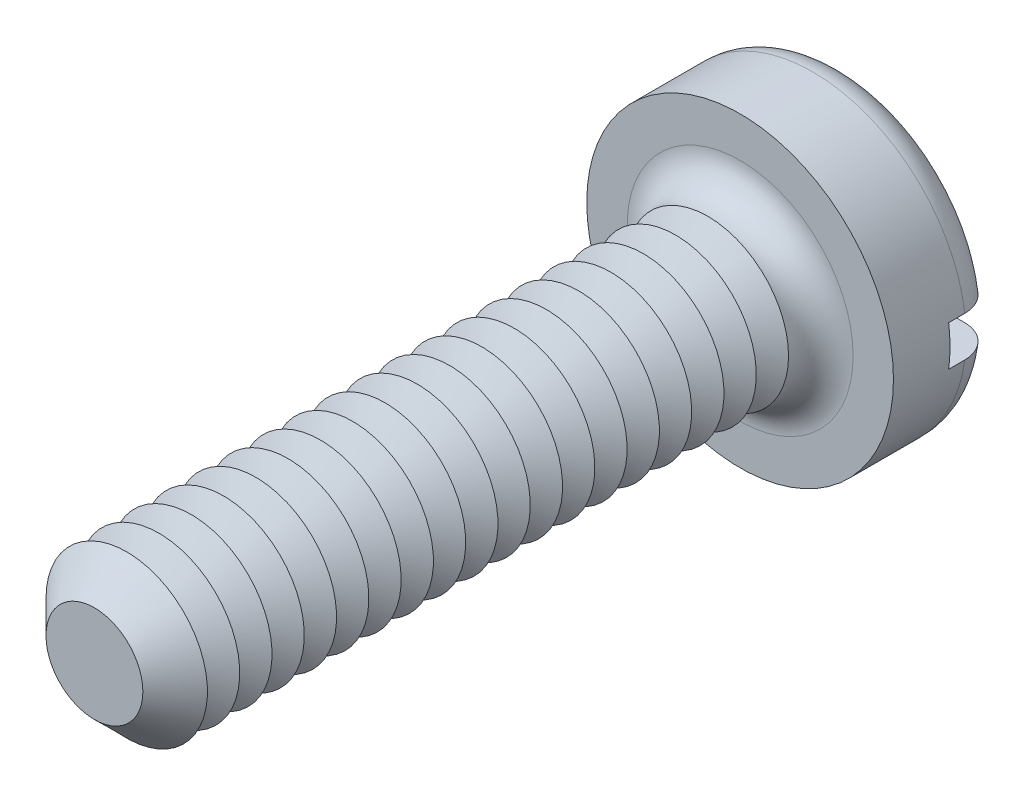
ISO-10303-21;
HEADER;
FILE_DESCRIPTION(('STEP AP214'),'2;1');
FILE_NAME('part.step','',(''),(''),'','','');
FILE_SCHEMA(('AUTOMOTIVE_DESIGN { 1 0 10303 214 1 1 1 1 }'));
ENDSEC;
DATA;
#1=APPLICATION_CONTEXT('core data for automotive mechanical design processes');
#2=APPLICATION_PROTOCOL_DEFINITION('international standard','automotive_design',2000,#1);
#3=PRODUCT_CONTEXT('',#1,'mechanical');
#4=PRODUCT('Part','Part','',(#3));
#5=PRODUCT_RELATED_PRODUCT_CATEGORY('part','',(#4));
#6=PRODUCT_DEFINITION_FORMATION('','',#4);
#7=PRODUCT_DEFINITION_CONTEXT('part definition',#1,'design');
#8=PRODUCT_DEFINITION('design','',#6,#7);
#9=PRODUCT_DEFINITION_SHAPE('','',#8);
#10=(LENGTH_UNIT() NAMED_UNIT(*) SI_UNIT(.MILLI.,.METRE.));
#11=(NAMED_UNIT(*) PLANE_ANGLE_UNIT() SI_UNIT($,.RADIAN.));
#12=(NAMED_UNIT(*) SI_UNIT($,.STERADIAN.) SOLID_ANGLE_UNIT());
#13=UNCERTAINTY_MEASURE_WITH_UNIT(LENGTH_MEASURE(1.E-05),#10,'distance_accuracy_value','');
#14=(GEOMETRIC_REPRESENTATION_CONTEXT(3) GLOBAL_UNCERTAINTY_ASSIGNED_CONTEXT((#13)) GLOBAL_UNIT_ASSIGNED_CONTEXT((#10,
#11,#12)) REPRESENTATION_CONTEXT('',''));
#15=CARTESIAN_POINT('',(0.,0.,0.));
#16=DIRECTION('',(0.,0.,1.));
#17=DIRECTION('',(1.,0.,0.));
#18=AXIS2_PLACEMENT_3D('',#15,#16,#17);
#19=CARTESIAN_POINT('',(0.,0.,-1.3));
#20=DIRECTION('',(0.,0.,1.));
#21=DIRECTION('',(1.,0.,0.));
#22=AXIS2_PLACEMENT_3D('',#19,#20,#21);
#23=PLANE('',#22);
#24=CARTESIAN_POINT('',(0.,0.,-1.3));
#25=DIRECTION('',(0.,0.,1.));
#26=DIRECTION('',(1.,0.,0.));
#27=AXIS2_PLACEMENT_3D('',#24,#25,#26);
#28=CIRCLE('',#27,1.5);
#29=CARTESIAN_POINT('',(-1.4790199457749,0.25,-1.3));
#30=VERTEX_POINT('',#29);
#31=CARTESIAN_POINT('',(1.4790199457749,0.25,-1.3));
#32=VERTEX_POINT('',#31);
#33=EDGE_CURVE('E116',#30,#32,#28,.F.);
#34=ORIENTED_EDGE('',*,*,#33,.T.);
#35=DIRECTION('',(1.,0.,0.));
#36=VECTOR('',#35,1.);
#37=CARTESIAN_POINT('',(-1.9,0.25,-1.3));
#38=LINE('',#37,#36);
#39=EDGE_CURVE('E111',#30,#32,#38,.T.);
#40=ORIENTED_EDGE('',*,*,#39,.F.);
#41=EDGE_LOOP('',(#34,#40));
#42=FACE_BOUND('',#41,.T.);
#43=ADVANCED_FACE('F39',(#42),#23,.F.);
#44=CARTESIAN_POINT('',(0.,0.,-0.9));
#45=DIRECTION('',(0.,0.,1.));
#46=DIRECTION('',(1.,0.,0.));
#47=AXIS2_PLACEMENT_3D('',#44,#45,#46);
#48=TOROIDAL_SURFACE('',#47,1.5,0.4);
#49=CARTESIAN_POINT('',(-1.8150392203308,0.25,-1.12284384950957));
#50=CARTESIAN_POINT('',(-1.80236980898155,0.25,-1.14155059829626));
#51=CARTESIAN_POINT('',(-1.78809920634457,0.25,-1.15919399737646));
#52=CARTESIAN_POINT('',(-1.75677844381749,0.25,-1.19184073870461));
#53=CARTESIAN_POINT('',(-1.73972468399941,0.25,-1.20684060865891));
#54=CARTESIAN_POINT('',(-1.70336024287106,0.25,-1.23375848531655));
#55=CARTESIAN_POINT('',(-1.68405164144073,0.25,-1.24567930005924));
#56=CARTESIAN_POINT('',(-1.64372549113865,0.25,-1.26613528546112));
#57=CARTESIAN_POINT('',(-1.6227083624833,0.25,-1.27467128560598));
#58=CARTESIAN_POINT('',(-1.57937988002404,0.25,-1.2881995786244));
#59=CARTESIAN_POINT('',(-1.55705957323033,0.25,-1.29316318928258));
#60=CARTESIAN_POINT('',(-1.51190394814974,0.25,-1.29931753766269));
#61=CARTESIAN_POINT('',(-1.48906857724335,0.25,-1.3005078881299));
#62=CARTESIAN_POINT('',(-1.4432641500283,0.25,-1.29909058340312));
#63=CARTESIAN_POINT('',(-1.42029638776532,0.25,-1.29644099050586));
#64=CARTESIAN_POINT('',(-1.37512297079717,0.25,-1.28735146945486));
#65=CARTESIAN_POINT('',(-1.3529173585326,0.25,-1.28091133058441));
#66=CARTESIAN_POINT('',(-1.30974098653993,0.25,-1.26436295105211));
#67=CARTESIAN_POINT('',(-1.28877978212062,0.25,-1.25422975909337));
#68=CARTESIAN_POINT('',(-1.24886205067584,0.25,-1.23057736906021));
#69=CARTESIAN_POINT('',(-1.22990554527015,0.25,-1.21705813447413));
#70=CARTESIAN_POINT('',(-1.19461911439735,0.25,-1.18704970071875));
#71=CARTESIAN_POINT('',(-1.17828051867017,0.25,-1.17057070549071));
#72=CARTESIAN_POINT('',(-1.14865897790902,0.25,-1.13506201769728));
#73=CARTESIAN_POINT('',(-1.13537576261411,0.25,-1.11603255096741));
#74=CARTESIAN_POINT('',(-1.11249827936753,0.25,-1.07630328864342));
#75=CARTESIAN_POINT('',(-1.10284494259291,0.25,-1.05563752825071));
#76=CARTESIAN_POINT('',(-1.08724024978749,0.25,-1.01295282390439));
#77=CARTESIAN_POINT('',(-1.08128829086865,0.25,-0.990934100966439));
#78=CARTESIAN_POINT('',(-1.07339124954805,0.25,-0.946722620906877));
#79=CARTESIAN_POINT('',(-1.07135558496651,0.25,-0.924546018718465));
#80=CARTESIAN_POINT('',(-1.07108722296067,0.25,-0.880170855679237));
#81=CARTESIAN_POINT('',(-1.07285419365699,0.25,-0.857972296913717));
#82=CARTESIAN_POINT('',(-1.0800838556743,0.25,-0.814463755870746));
#83=CARTESIAN_POINT('',(-1.08550159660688,0.25,-0.793146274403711));
#84=CARTESIAN_POINT('',(-1.09980522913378,0.25,-0.751709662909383));
#85=CARTESIAN_POINT('',(-1.10869126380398,0.25,-0.731590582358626));
#86=CARTESIAN_POINT('',(-1.12975121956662,0.25,-0.692901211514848));
#87=CARTESIAN_POINT('',(-1.14195627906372,0.25,-0.674347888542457));
#88=CARTESIAN_POINT('',(-1.1692428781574,0.25,-0.639494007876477));
#89=CARTESIAN_POINT('',(-1.18432473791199,0.25,-0.623193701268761));
#90=CARTESIAN_POINT('',(-1.21730350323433,0.25,-0.592916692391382));
#91=CARTESIAN_POINT('',(-1.23525650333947,0.25,-0.579001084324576));
#92=CARTESIAN_POINT('',(-1.27320799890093,0.25,-0.554314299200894));
#93=CARTESIAN_POINT('',(-1.2932067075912,0.25,-0.543543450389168));
#94=CARTESIAN_POINT('',(-1.33509120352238,0.25,-0.525253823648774));
#95=CARTESIAN_POINT('',(-1.35700545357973,0.25,-0.517800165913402));
#96=CARTESIAN_POINT('',(-1.401770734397,0.25,-0.506652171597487));
#97=CARTESIAN_POINT('',(-1.42462180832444,0.25,-0.502958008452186));
#98=CARTESIAN_POINT('',(-1.4707602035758,0.25,-0.499429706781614));
#99=CARTESIAN_POINT('',(-1.49404932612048,0.25,-0.499619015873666));
#100=CARTESIAN_POINT('',(-1.54026206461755,0.25,-0.50392615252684));
#101=CARTESIAN_POINT('',(-1.56318568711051,0.25,-0.508043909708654));
#102=CARTESIAN_POINT('',(-1.60788420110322,0.25,-0.520077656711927));
#103=CARTESIAN_POINT('',(-1.6296645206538,0.25,-0.527973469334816));
#104=CARTESIAN_POINT('',(-1.67156889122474,0.25,-0.547348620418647));
#105=CARTESIAN_POINT('',(-1.69169302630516,0.25,-0.558827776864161));
#106=CARTESIAN_POINT('',(-1.72948251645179,0.25,-0.584913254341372));
#107=CARTESIAN_POINT('',(-1.74717189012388,0.25,-0.599484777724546));
#108=CARTESIAN_POINT('',(-1.77981909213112,0.25,-0.63142070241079));
#109=CARTESIAN_POINT('',(-1.79477707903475,0.25,-0.648784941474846));
#110=CARTESIAN_POINT('',(-1.82136524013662,0.25,-0.685607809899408));
#111=CARTESIAN_POINT('',(-1.83303003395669,0.25,-0.705041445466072));
#112=CARTESIAN_POINT('',(-1.85289960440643,0.25,-0.745602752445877));
#113=CARTESIAN_POINT('',(-1.86110468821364,0.25,-0.76673027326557));
#114=CARTESIAN_POINT('',(-1.87375648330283,0.25,-0.809891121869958));
#115=CARTESIAN_POINT('',(-1.87823381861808,0.25,-0.831915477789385));
#116=CARTESIAN_POINT('',(-1.88341152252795,0.25,-0.87640983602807));
#117=CARTESIAN_POINT('',(-1.88411103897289,0.25,-0.898879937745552));
#118=CARTESIAN_POINT('',(-1.88171559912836,0.25,-0.943534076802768));
#119=CARTESIAN_POINT('',(-1.87863413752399,0.25,-0.965718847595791));
#120=CARTESIAN_POINT('',(-1.86879153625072,0.25,-1.00923650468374));
#121=CARTESIAN_POINT('',(-1.86203494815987,0.25,-1.03057040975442));
#122=CARTESIAN_POINT('',(-1.84837477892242,0.25,-1.06373797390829));
#123=CARTESIAN_POINT('',(-1.84255723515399,0.25,-1.07603047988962));
#124=CARTESIAN_POINT('',(-1.82969924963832,0.25,-1.09995814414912));
#125=CARTESIAN_POINT('',(-1.82265881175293,0.25,-1.11159330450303));
#126=CARTESIAN_POINT('',(-1.8150392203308,0.25,-1.12284384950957));
#127=B_SPLINE_CURVE_WITH_KNOTS('',3,(#49,#50,#51,#52,#53,#54,#55,#56,#57,#58,#59,#60,#61,#62,
#63,#64,#65,#66,#67,#68,#69,#70,#71,#72,#73,#74,#75,#76,#77,#78,#79,#80,#81,#82,#83,#84,#85,#86,
#87,#88,#89,#90,#91,#92,#93,#94,#95,#96,#97,#98,#99,#100,#101,#102,#103,#104,#105,#106,#107,
#108,#109,#110,#111,#112,#113,#114,#115,#116,#117,#118,#119,#120,#121,#122,#123,#124,#125,#126),
.UNSPECIFIED.,.T.,.F.,(4,2,2,2,2,2,2,2,2,2,2,2,2,2,2,2,2,2,2,2,2,2,2,2,2,2,2,2,2,2,2,2,2,2,2,2,
2,2,4),(0.,0.0677296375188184,0.135547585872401,0.203303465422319,0.27104273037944,
0.339319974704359,0.407604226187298,0.47663988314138,0.545679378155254,0.615194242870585,
0.684709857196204,0.753990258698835,0.82326452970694,0.891356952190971,0.959438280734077,
1.02592503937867,1.0924059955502,1.15808300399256,1.2237627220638,1.29008126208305,
1.35640718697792,1.4242376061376,1.49207510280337,1.5611911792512,1.63031044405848,
1.69984715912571,1.76938262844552,1.8385508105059,1.90771547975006,1.97613962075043,
2.04455978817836,2.11223135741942,2.17989691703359,2.24700094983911,2.31412011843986,
2.38100042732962,2.44779809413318,2.48853193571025,2.52926564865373),.UNSPECIFIED.);
#128=CARTESIAN_POINT('',(-1.88348082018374,0.25,-0.9));
#129=VERTEX_POINT('',#128);
#130=EDGE_CURVE('E323',#129,#30,#127,.T.);
#131=ORIENTED_EDGE('',*,*,#130,.F.);
#132=CARTESIAN_POINT('',(0.,0.,-0.9));
#133=DIRECTION('',(0.,0.,1.));
#134=DIRECTION('',(1.,0.,0.));
#135=AXIS2_PLACEMENT_3D('',#132,#133,#134);
#136=CIRCLE('',#135,1.9);
#137=CARTESIAN_POINT('',(1.88348082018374,0.25,-0.9));
#138=VERTEX_POINT('',#137);
#139=EDGE_CURVE('E125',#138,#129,#136,.T.);
#140=ORIENTED_EDGE('',*,*,#139,.F.);
#141=CARTESIAN_POINT('',(1.11362660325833,0.25,-1.07710243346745));
#142=CARTESIAN_POINT('',(1.12388366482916,0.25,-1.09736755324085));
#143=CARTESIAN_POINT('',(1.13589127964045,0.25,-1.11676768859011));
#144=CARTESIAN_POINT('',(1.16301945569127,0.25,-1.15328107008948));
#145=CARTESIAN_POINT('',(1.17814463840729,0.25,-1.17039085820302));
#146=CARTESIAN_POINT('',(1.21101661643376,0.25,-1.20182395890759));
#147=CARTESIAN_POINT('',(1.22875976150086,0.25,-1.21615108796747));
#148=CARTESIAN_POINT('',(1.26636392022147,0.25,-1.24166932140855));
#149=CARTESIAN_POINT('',(1.28622436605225,0.25,-1.25286126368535));
#150=CARTESIAN_POINT('',(1.32781377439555,0.25,-1.27196191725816));
#151=CARTESIAN_POINT('',(1.34956550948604,0.25,-1.27982107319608));
#152=CARTESIAN_POINT('',(1.39407620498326,0.25,-1.29180513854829));
#153=CARTESIAN_POINT('',(1.41683526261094,0.25,-1.29592968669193));
#154=CARTESIAN_POINT('',(1.46288034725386,0.25,-1.3003367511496));
#155=CARTESIAN_POINT('',(1.48616890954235,0.25,-1.30059287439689));
#156=CARTESIAN_POINT('',(1.53245605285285,0.25,-1.29717239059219));
#157=CARTESIAN_POINT('',(1.55545463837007,0.25,-1.29349584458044));
#158=CARTESIAN_POINT('',(1.60038828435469,0.25,-1.28232271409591));
#159=CARTESIAN_POINT('',(1.62232790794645,0.25,-1.27484449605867));
#160=CARTESIAN_POINT('',(1.66461970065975,0.25,-1.25627203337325));
#161=CARTESIAN_POINT('',(1.68497195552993,0.25,-1.24517798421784));
#162=CARTESIAN_POINT('',(1.72328060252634,0.25,-1.21981269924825));
#163=CARTESIAN_POINT('',(1.74126001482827,0.25,-1.2055762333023));
#164=CARTESIAN_POINT('',(1.77453973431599,0.25,-1.17425606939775));
#165=CARTESIAN_POINT('',(1.78984019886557,0.25,-1.1571725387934));
#166=CARTESIAN_POINT('',(1.81715014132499,0.25,-1.12084732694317));
#167=CARTESIAN_POINT('',(1.82919410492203,0.25,-1.10163156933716));
#168=CARTESIAN_POINT('',(1.84985315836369,0.25,-1.06143759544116));
#169=CARTESIAN_POINT('',(1.85846842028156,0.25,-1.04045946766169));
#170=CARTESIAN_POINT('',(1.87195437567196,0.25,-0.997526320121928));
#171=CARTESIAN_POINT('',(1.87685590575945,0.25,-0.975580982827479));
#172=CARTESIAN_POINT('',(1.88288741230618,0.25,-0.931178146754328));
#173=CARTESIAN_POINT('',(1.88401750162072,0.25,-0.908720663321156));
#174=CARTESIAN_POINT('',(1.88247598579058,0.25,-0.864033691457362));
#175=CARTESIAN_POINT('',(1.87982069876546,0.25,-0.841803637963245));
#176=CARTESIAN_POINT('',(1.87081646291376,0.25,-0.798104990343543));
#177=CARTESIAN_POINT('',(1.86446754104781,0.25,-0.776636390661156));
#178=CARTESIAN_POINT('',(1.84826063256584,0.25,-0.735060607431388));
#179=CARTESIAN_POINT('',(1.83840161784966,0.25,-0.714953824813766));
#180=CARTESIAN_POINT('',(1.81546327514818,0.25,-0.676670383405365));
#181=CARTESIAN_POINT('',(1.80238389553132,0.25,-0.658493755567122));
#182=CARTESIAN_POINT('',(1.77331327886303,0.25,-0.62448916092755));
#183=CARTESIAN_POINT('',(1.75730833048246,0.25,-0.608672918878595));
#184=CARTESIAN_POINT('',(1.72289038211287,0.25,-0.579924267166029));
#185=CARTESIAN_POINT('',(1.70447729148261,0.25,-0.566991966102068));
#186=CARTESIAN_POINT('',(1.66559643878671,0.25,-0.544254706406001));
#187=CARTESIAN_POINT('',(1.64511218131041,0.25,-0.53447796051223));
#188=CARTESIAN_POINT('',(1.60280554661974,0.25,-0.518459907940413));
#189=CARTESIAN_POINT('',(1.58098309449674,0.25,-0.512218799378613));
#190=CARTESIAN_POINT('',(1.53636184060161,0.25,-0.503375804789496));
#191=CARTESIAN_POINT('',(1.51355490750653,0.25,-0.500814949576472));
#192=CARTESIAN_POINT('',(1.46783245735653,0.25,-0.499516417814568));
#193=CARTESIAN_POINT('',(1.44491693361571,0.25,-0.500778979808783));
#194=CARTESIAN_POINT('',(1.39937748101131,0.25,-0.50711284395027));
#195=CARTESIAN_POINT('',(1.37675897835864,0.25,-0.512223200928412));
#196=CARTESIAN_POINT('',(1.33269286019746,0.25,-0.526151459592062));
#197=CARTESIAN_POINT('',(1.31124530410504,0.25,-0.534969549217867));
#198=CARTESIAN_POINT('',(1.27004097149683,0.25,-0.556118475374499));
#199=CARTESIAN_POINT('',(1.25029179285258,0.25,-0.568464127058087));
#200=CARTESIAN_POINT('',(1.21316554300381,0.25,-0.59631968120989));
#201=CARTESIAN_POINT('',(1.19578844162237,0.25,-0.611829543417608));
#202=CARTESIAN_POINT('',(1.16406059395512,0.25,-0.645459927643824));
#203=CARTESIAN_POINT('',(1.14968747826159,0.25,-0.663559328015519));
#204=CARTESIAN_POINT('',(1.12425968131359,0.25,-0.70195566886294));
#205=CARTESIAN_POINT('',(1.11320445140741,0.25,-0.722252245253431));
#206=CARTESIAN_POINT('',(1.09497726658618,0.25,-0.764020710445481));
#207=CARTESIAN_POINT('',(1.08772970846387,0.25,-0.785459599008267));
#208=CARTESIAN_POINT('',(1.07702618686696,0.25,-0.829269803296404));
#209=CARTESIAN_POINT('',(1.07357062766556,0.25,-0.851641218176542));
#210=CARTESIAN_POINT('',(1.07060826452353,0.25,-0.896160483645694));
#211=CARTESIAN_POINT('',(1.07101876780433,0.25,-0.918302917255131));
#212=CARTESIAN_POINT('',(1.07557730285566,0.25,-0.962179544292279));
#213=CARTESIAN_POINT('',(1.07972048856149,0.25,-0.983914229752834));
#214=CARTESIAN_POINT('',(1.08912066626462,0.25,-1.01754924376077));
#215=CARTESIAN_POINT('',(1.09320341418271,0.25,-1.02979035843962));
#216=CARTESIAN_POINT('',(1.10254493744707,0.25,-1.05381470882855));
#217=CARTESIAN_POINT('',(1.10780368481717,0.25,-1.06559795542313));
#218=CARTESIAN_POINT('',(1.11362660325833,0.25,-1.07710243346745));
#219=B_SPLINE_CURVE_WITH_KNOTS('',3,(#141,#142,#143,#144,#145,#146,#147,#148,#149,#150,#151,
#152,#153,#154,#155,#156,#157,#158,#159,#160,#161,#162,#163,#164,#165,#166,#167,#168,#169,#170,
#171,#172,#173,#174,#175,#176,#177,#178,#179,#180,#181,#182,#183,#184,#185,#186,#187,#188,#189,
#190,#191,#192,#193,#194,#195,#196,#197,#198,#199,#200,#201,#202,#203,#204,#205,#206,#207,#208,
#209,#210,#211,#212,#213,#214,#215,#216,#217,#218),.UNSPECIFIED.,.T.,.F.,(4,2,2,2,2,2,2,2,2,2,2,
2,2,2,2,2,2,2,2,2,2,2,2,2,2,2,2,2,2,2,2,2,2,2,2,2,2,2,4),(0.,0.0680907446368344,
0.136283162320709,0.204381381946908,0.272461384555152,0.341520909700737,0.410587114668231,
0.480124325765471,0.549660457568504,0.618863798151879,0.688063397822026,0.756532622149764,
0.824997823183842,0.892706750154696,0.960412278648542,1.02754926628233,1.09468424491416,
1.16153068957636,1.22837664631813,1.29524219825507,1.36210882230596,1.42929726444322,
1.49648823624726,1.56426429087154,1.63204414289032,1.70057395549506,1.76910804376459,
1.83834728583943,1.90759003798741,1.97712798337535,2.0466650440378,2.11566422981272,
2.18465199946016,2.25221259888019,2.3197804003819,2.38590630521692,2.45194648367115,
2.49060241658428,2.5292574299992),.UNSPECIFIED.);
#220=EDGE_CURVE('E325',#32,#138,#219,.T.);
#221=ORIENTED_EDGE('',*,*,#220,.F.);
#222=ORIENTED_EDGE('',*,*,#33,.F.);
#223=EDGE_LOOP('',(#131,#140,#221,#222));
#224=FACE_BOUND('',#223,.T.);
#225=ADVANCED_FACE('F307',(#224),#48,.T.);
#226=CARTESIAN_POINT('',(0.,0.,-1.3));
#227=DIRECTION('',(0.,0.,1.));
#228=DIRECTION('',(1.,0.,0.));
#229=AXIS2_PLACEMENT_3D('',#226,#227,#228);
#230=CYLINDRICAL_SURFACE('',#229,1.9);
#231=DIRECTION('',(0.,0.,1.));
#232=VECTOR('',#231,1.);
#233=CARTESIAN_POINT('',(1.88348082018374,0.25,-1.3));
#234=LINE('',#233,#232);
#235=CARTESIAN_POINT('',(1.88348082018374,0.25,-0.7));
#236=VERTEX_POINT('',#235);
#237=EDGE_CURVE('E340',#138,#236,#234,.T.);
#238=ORIENTED_EDGE('',*,*,#237,.F.);
#239=ORIENTED_EDGE('',*,*,#139,.T.);
#240=DIRECTION('',(0.,0.,1.));
#241=VECTOR('',#240,1.);
#242=CARTESIAN_POINT('',(-1.88348082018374,0.25,-1.3));
#243=LINE('',#242,#241);
#244=CARTESIAN_POINT('',(-1.88348082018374,0.25,-0.7));
#245=VERTEX_POINT('',#244);
#246=EDGE_CURVE('E63',#245,#129,#243,.F.);
#247=ORIENTED_EDGE('',*,*,#246,.F.);
#248=CARTESIAN_POINT('',(0.,0.,-0.7));
#249=DIRECTION('',(0.,0.,-1.));
#250=DIRECTION('',(-1.,0.,0.));
#251=AXIS2_PLACEMENT_3D('',#248,#249,#250);
#252=CIRCLE('',#251,1.9);
#253=CARTESIAN_POINT('',(-1.88348082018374,-0.25,-0.7));
#254=VERTEX_POINT('',#253);
#255=EDGE_CURVE('E43',#245,#254,#252,.F.);
#256=ORIENTED_EDGE('',*,*,#255,.T.);
#257=DIRECTION('',(0.,0.,1.));
#258=VECTOR('',#257,1.);
#259=CARTESIAN_POINT('',(-1.88348082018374,-0.25,-1.3));
#260=LINE('',#259,#258);
#261=CARTESIAN_POINT('',(-1.88348082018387,-0.25,-0.899999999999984));
#262=VERTEX_POINT('',#261);
#263=EDGE_CURVE('E337',#262,#254,#260,.T.);
#264=ORIENTED_EDGE('',*,*,#263,.F.);
#265=CARTESIAN_POINT('',(1.88348082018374,-0.25,-0.9));
#266=VERTEX_POINT('',#265);
#267=EDGE_CURVE('E127',#262,#266,#136,.T.);
#268=ORIENTED_EDGE('',*,*,#267,.T.);
#269=DIRECTION('',(0.,0.,1.));
#270=VECTOR('',#269,1.);
#271=CARTESIAN_POINT('',(1.88348082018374,-0.25,-1.3));
#272=LINE('',#271,#270);
#273=CARTESIAN_POINT('',(1.88348082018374,-0.25,-0.7));
#274=VERTEX_POINT('',#273);
#275=EDGE_CURVE('E55',#274,#266,#272,.F.);
#276=ORIENTED_EDGE('',*,*,#275,.F.);
#277=EDGE_CURVE('E11',#274,#236,#252,.F.);
#278=ORIENTED_EDGE('',*,*,#277,.T.);
#279=EDGE_LOOP('',(#238,#239,#247,#256,#264,#268,#276,#278));
#280=FACE_BOUND('',#279,.T.);
#281=CARTESIAN_POINT('',(0.,0.,0.));
#282=DIRECTION('',(0.,0.,1.));
#283=DIRECTION('',(1.,0.,0.));
#284=AXIS2_PLACEMENT_3D('',#281,#282,#283);
#285=CIRCLE('',#284,1.9);
#286=CARTESIAN_POINT('',(1.9,0.,0.));
#287=VERTEX_POINT('',#286);
#288=EDGE_CURVE('E343',#287,#287,#285,.T.);
#289=ORIENTED_EDGE('',*,*,#288,.F.);
#290=EDGE_LOOP('',(#289));
#291=FACE_BOUND('',#290,.T.);
#292=ADVANCED_FACE('F303',(#280,#291),#230,.T.);
#293=CARTESIAN_POINT('',(1.4790199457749,-0.25,-1.3));
#294=VERTEX_POINT('',#293);
#295=CARTESIAN_POINT('',(-1.4790199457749,-0.25,-1.3));
#296=VERTEX_POINT('',#295);
#297=EDGE_CURVE('E109',#294,#296,#28,.F.);
#298=ORIENTED_EDGE('',*,*,#297,.T.);
#299=DIRECTION('',(-1.,0.,0.));
#300=VECTOR('',#299,1.);
#301=CARTESIAN_POINT('',(-1.9,-0.25,-1.3));
#302=LINE('',#301,#300);
#303=EDGE_CURVE('E96',#294,#296,#302,.T.);
#304=ORIENTED_EDGE('',*,*,#303,.F.);
#305=EDGE_LOOP('',(#298,#304));
#306=FACE_BOUND('',#305,.T.);
#307=ADVANCED_FACE('F108',(#306),#23,.F.);
#308=CARTESIAN_POINT('',(0.,0.,0.));
#309=DIRECTION('',(0.,0.,1.));
#310=DIRECTION('',(1.,0.,0.));
#311=AXIS2_PLACEMENT_3D('',#308,#309,#310);
#312=PLANE('',#311);
#313=CARTESIAN_POINT('',(0.,0.,0.));
#314=DIRECTION('',(0.,0.,1.));
#315=DIRECTION('',(1.,0.,0.));
#316=AXIS2_PLACEMENT_3D('',#313,#314,#315);
#317=CIRCLE('',#316,1.4);
#318=CARTESIAN_POINT('',(1.4,0.,0.));
#319=VERTEX_POINT('',#318);
#320=EDGE_CURVE('E115',#319,#319,#317,.F.);
#321=ORIENTED_EDGE('',*,*,#320,.T.);
#322=EDGE_LOOP('',(#321));
#323=FACE_BOUND('',#322,.T.);
#324=ORIENTED_EDGE('',*,*,#288,.T.);
#325=EDGE_LOOP('',(#324));
#326=FACE_BOUND('',#325,.T.);
#327=ADVANCED_FACE('F302',(#323,#326),#312,.T.);
#328=CARTESIAN_POINT('',(-1.8150392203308,-0.25,-1.12284384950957));
#329=CARTESIAN_POINT('',(-1.82756185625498,-0.25,-1.10435021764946));
#330=CARTESIAN_POINT('',(-1.83853807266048,-0.25,-1.08479072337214));
#331=CARTESIAN_POINT('',(-1.85706233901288,-0.25,-1.04409188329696));
#332=CARTESIAN_POINT('',(-1.86460655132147,-0.25,-1.02295079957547));
#333=CARTESIAN_POINT('',(-1.87603074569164,-0.25,-0.979704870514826));
#334=CARTESIAN_POINT('',(-1.87991177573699,-0.25,-0.957600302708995));
#335=CARTESIAN_POINT('',(-1.88389586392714,-0.25,-0.913058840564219));
#336=CARTESIAN_POINT('',(-1.88399981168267,-0.25,-0.890622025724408));
#337=CARTESIAN_POINT('',(-1.88043374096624,-0.25,-0.846104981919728));
#338=CARTESIAN_POINT('',(-1.87677281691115,-0.25,-0.824024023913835));
#339=CARTESIAN_POINT('',(-1.86579880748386,-0.25,-0.780788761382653));
#340=CARTESIAN_POINT('',(-1.85848560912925,-0.25,-0.759634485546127));
#341=CARTESIAN_POINT('',(-1.8404137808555,-0.25,-0.718830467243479));
#342=CARTESIAN_POINT('',(-1.82965205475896,-0.25,-0.699182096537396));
#343=CARTESIAN_POINT('',(-1.80499939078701,-0.25,-0.661958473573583));
#344=CARTESIAN_POINT('',(-1.7911083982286,-0.25,-0.644383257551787));
#345=CARTESIAN_POINT('',(-1.76051564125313,-0.25,-0.611699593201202));
#346=CARTESIAN_POINT('',(-1.74379913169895,-0.25,-0.596604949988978));
#347=CARTESIAN_POINT('',(-1.70808901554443,-0.25,-0.569406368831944));
#348=CARTESIAN_POINT('',(-1.68909532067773,-0.25,-0.557302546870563));
#349=CARTESIAN_POINT('',(-1.64918615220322,-0.25,-0.536307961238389));
#350=CARTESIAN_POINT('',(-1.62825469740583,-0.25,-0.527447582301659));
#351=CARTESIAN_POINT('',(-1.58521203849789,-0.25,-0.513323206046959));
#352=CARTESIAN_POINT('',(-1.5631007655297,-0.25,-0.508059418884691));
#353=CARTESIAN_POINT('',(-1.51806209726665,-0.25,-0.501215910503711));
#354=CARTESIAN_POINT('',(-1.4951283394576,-0.25,-0.499678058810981));
#355=CARTESIAN_POINT('',(-1.4493239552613,-0.25,-0.500434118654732));
#356=CARTESIAN_POINT('',(-1.4264533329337,-0.25,-0.502728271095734));
#357=CARTESIAN_POINT('',(-1.38118643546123,-0.25,-0.511115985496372));
#358=CARTESIAN_POINT('',(-1.35879703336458,-0.25,-0.51724667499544));
#359=CARTESIAN_POINT('',(-1.31535851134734,-0.25,-0.533167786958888));
#360=CARTESIAN_POINT('',(-1.29430945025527,-0.25,-0.542958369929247));
#361=CARTESIAN_POINT('',(-1.25409242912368,-0.25,-0.565968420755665));
#362=CARTESIAN_POINT('',(-1.23493023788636,-0.25,-0.579197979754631));
#363=CARTESIAN_POINT('',(-1.19912477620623,-0.25,-0.608715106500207));
#364=CARTESIAN_POINT('',(-1.18248143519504,-0.25,-0.625002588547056));
#365=CARTESIAN_POINT('',(-1.15237533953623,-0.25,-0.660018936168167));
#366=CARTESIAN_POINT('',(-1.13888343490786,-0.25,-0.678722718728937));
#367=CARTESIAN_POINT('',(-1.115312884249,-0.25,-0.718170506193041));
#368=CARTESIAN_POINT('',(-1.10523377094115,-0.25,-0.738914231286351));
#369=CARTESIAN_POINT('',(-1.08901310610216,-0.25,-0.781372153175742));
#370=CARTESIAN_POINT('',(-1.08279080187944,-0.25,-0.803055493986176));
#371=CARTESIAN_POINT('',(-1.07416105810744,-0.25,-0.847167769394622));
#372=CARTESIAN_POINT('',(-1.07175306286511,-0.25,-0.869596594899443));
#373=CARTESIAN_POINT('',(-1.07084656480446,-0.25,-0.914070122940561));
#374=CARTESIAN_POINT('',(-1.07226874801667,-0.25,-0.936113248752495));
#375=CARTESIAN_POINT('',(-1.07880428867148,-0.25,-0.979644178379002));
#376=CARTESIAN_POINT('',(-1.08391755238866,-0.25,-1.00113199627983));
#377=CARTESIAN_POINT('',(-1.09764616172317,-0.25,-1.04290115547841));
#378=CARTESIAN_POINT('',(-1.10625346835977,-0.25,-1.06318514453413));
#379=CARTESIAN_POINT('',(-1.12669365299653,-0.25,-1.10205584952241));
#380=CARTESIAN_POINT('',(-1.13852679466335,-0.25,-1.12064242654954));
#381=CARTESIAN_POINT('',(-1.16529672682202,-0.25,-1.15594801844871));
#382=CARTESIAN_POINT('',(-1.18028464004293,-0.25,-1.17262825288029));
#383=CARTESIAN_POINT('',(-1.21279183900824,-0.25,-1.20330600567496));
#384=CARTESIAN_POINT('',(-1.23031142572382,-0.25,-1.21730320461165));
#385=CARTESIAN_POINT('',(-1.26781695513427,-0.25,-1.24254670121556));
#386=CARTESIAN_POINT('',(-1.28784999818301,-0.25,-1.25372305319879));
#387=CARTESIAN_POINT('',(-1.3294899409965,-0.25,-1.27260611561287));
#388=CARTESIAN_POINT('',(-1.35109697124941,-0.25,-1.28031253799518));
#389=CARTESIAN_POINT('',(-1.39558575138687,-0.25,-1.29212626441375));
#390=CARTESIAN_POINT('',(-1.4184807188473,-0.25,-1.29618386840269));
#391=CARTESIAN_POINT('',(-1.4646266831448,-0.25,-1.30039947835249));
#392=CARTESIAN_POINT('',(-1.48787767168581,-0.25,-1.30055757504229));
#393=CARTESIAN_POINT('',(-1.53407883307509,-0.25,-1.29695468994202));
#394=CARTESIAN_POINT('',(-1.55702895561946,-0.25,-1.29319306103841));
#395=CARTESIAN_POINT('',(-1.60196718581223,-0.25,-1.28183520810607));
#396=CARTESIAN_POINT('',(-1.62395508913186,-0.25,-1.27423817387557));
#397=CARTESIAN_POINT('',(-1.66614393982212,-0.25,-1.25548646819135));
#398=CARTESIAN_POINT('',(-1.68635782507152,-0.25,-1.24436087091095));
#399=CARTESIAN_POINT('',(-1.72458266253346,-0.25,-1.21884344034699));
#400=CARTESIAN_POINT('',(-1.74259637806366,-0.25,-1.20445577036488));
#401=CARTESIAN_POINT('',(-1.76968989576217,-0.25,-1.1787247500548));
#402=CARTESIAN_POINT('',(-1.77959984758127,-0.25,-1.1682407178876));
#403=CARTESIAN_POINT('',(-1.79823423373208,-0.25,-1.14626700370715));
#404=CARTESIAN_POINT('',(-1.80695867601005,-0.25,-1.1347773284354));
#405=CARTESIAN_POINT('',(-1.8150392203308,-0.25,-1.12284384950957));
#406=B_SPLINE_CURVE_WITH_KNOTS('',3,(#328,#329,#330,#331,#332,#333,#334,#335,#336,#337,#338,
#339,#340,#341,#342,#343,#344,#345,#346,#347,#348,#349,#350,#351,#352,#353,#354,#355,#356,#357,
#358,#359,#360,#361,#362,#363,#364,#365,#366,#367,#368,#369,#370,#371,#372,#373,#374,#375,#376,
#377,#378,#379,#380,#381,#382,#383,#384,#385,#386,#387,#388,#389,#390,#391,#392,#393,#394,#395,
#396,#397,#398,#399,#400,#401,#402,#403,#404,#405),.UNSPECIFIED.,.T.,.F.,(4,2,2,2,2,2,2,2,2,2,2,
2,2,2,2,2,2,2,2,2,2,2,2,2,2,2,2,2,2,2,2,2,2,2,2,2,2,2,4),(0.,0.0669512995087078,
0.133977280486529,0.200984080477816,0.267975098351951,0.334804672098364,0.401636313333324,
0.468528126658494,0.535421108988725,0.602674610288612,0.669930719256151,0.737801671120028,
0.805676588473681,0.87431077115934,0.942949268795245,1.0122625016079,1.08157877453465,
1.15110078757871,1.22062085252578,1.28946987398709,1.35830946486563,1.42565417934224,
1.49298908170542,1.55894041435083,1.62489007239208,1.69068884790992,1.75649300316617,
1.82345932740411,1.89043361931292,1.95893391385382,2.02743989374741,2.09686543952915,
2.16628937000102,2.23572476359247,2.3051748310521,2.3740669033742,2.44287154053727,
2.48607383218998,2.52927583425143),.UNSPECIFIED.);
#407=EDGE_CURVE('E103',#296,#262,#406,.T.);
#408=ORIENTED_EDGE('',*,*,#407,.F.);
#409=ORIENTED_EDGE('',*,*,#297,.F.);
#410=CARTESIAN_POINT('',(1.11362660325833,-0.25,-1.07710243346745));
#411=CARTESIAN_POINT('',(1.10368387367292,-0.25,-1.05745397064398));
#412=CARTESIAN_POINT('',(1.09537204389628,-0.25,-1.0369644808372));
#413=CARTESIAN_POINT('',(1.08229212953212,-0.25,-0.994867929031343));
#414=CARTESIAN_POINT('',(1.07752732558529,-0.25,-0.973259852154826));
#415=CARTESIAN_POINT('',(1.07171197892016,-0.25,-0.929545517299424));
#416=CARTESIAN_POINT('',(1.07066166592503,-0.25,-0.907439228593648));
#417=CARTESIAN_POINT('',(1.07231382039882,-0.25,-0.863372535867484));
#418=CARTESIAN_POINT('',(1.07501551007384,-0.25,-0.841412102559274));
#419=CARTESIAN_POINT('',(1.08404966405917,-0.25,-0.798386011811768));
#420=CARTESIAN_POINT('',(1.09036099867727,-0.25,-0.777315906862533));
#421=CARTESIAN_POINT('',(1.10638973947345,-0.25,-0.736514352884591));
#422=CARTESIAN_POINT('',(1.11610743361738,-0.25,-0.716783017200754));
#423=CARTESIAN_POINT('',(1.13878208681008,-0.25,-0.678952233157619));
#424=CARTESIAN_POINT('',(1.15177705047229,-0.25,-0.660875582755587));
#425=CARTESIAN_POINT('',(1.18055347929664,-0.25,-0.62709692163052));
#426=CARTESIAN_POINT('',(1.19633525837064,-0.25,-0.611395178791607));
#427=CARTESIAN_POINT('',(1.23062926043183,-0.25,-0.582430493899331));
#428=CARTESIAN_POINT('',(1.24919608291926,-0.25,-0.569232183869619));
#429=CARTESIAN_POINT('',(1.28825118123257,-0.25,-0.546076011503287));
#430=CARTESIAN_POINT('',(1.30873964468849,-0.25,-0.536118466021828));
#431=CARTESIAN_POINT('',(1.35144534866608,-0.25,-0.519560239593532));
#432=CARTESIAN_POINT('',(1.3736865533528,-0.25,-0.513021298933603));
#433=CARTESIAN_POINT('',(1.41894945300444,-0.25,-0.503751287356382));
#434=CARTESIAN_POINT('',(1.44197117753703,-0.25,-0.50102036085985));
#435=CARTESIAN_POINT('',(1.48824913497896,-0.25,-0.499449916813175));
#436=CARTESIAN_POINT('',(1.5115059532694,-0.25,-0.500627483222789));
#437=CARTESIAN_POINT('',(1.55748678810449,-0.25,-0.506895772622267));
#438=CARTESIAN_POINT('',(1.58021081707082,-0.25,-0.511986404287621));
#439=CARTESIAN_POINT('',(1.6243247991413,-0.25,-0.525910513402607));
#440=CARTESIAN_POINT('',(1.64572225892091,-0.25,-0.534720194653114));
#441=CARTESIAN_POINT('',(1.68671060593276,-0.25,-0.555845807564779));
#442=CARTESIAN_POINT('',(1.70630159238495,-0.25,-0.568161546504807));
#443=CARTESIAN_POINT('',(1.74289060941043,-0.25,-0.595805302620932));
#444=CARTESIAN_POINT('',(1.75991474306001,-0.25,-0.611098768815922));
#445=CARTESIAN_POINT('',(1.79111916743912,-0.25,-0.644354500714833));
#446=CARTESIAN_POINT('',(1.80529962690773,-0.25,-0.662316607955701));
#447=CARTESIAN_POINT('',(1.83025525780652,-0.25,-0.700191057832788));
#448=CARTESIAN_POINT('',(1.84106535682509,-0.25,-0.720080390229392));
#449=CARTESIAN_POINT('',(1.8591630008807,-0.25,-0.761401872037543));
#450=CARTESIAN_POINT('',(1.86645070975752,-0.25,-0.782833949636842));
#451=CARTESIAN_POINT('',(1.87724305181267,-0.25,-0.826454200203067));
#452=CARTESIAN_POINT('',(1.88077646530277,-0.25,-0.848635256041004));
#453=CARTESIAN_POINT('',(1.88405487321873,-0.25,-0.89327539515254));
#454=CARTESIAN_POINT('',(1.88379996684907,-0.25,-0.915734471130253));
#455=CARTESIAN_POINT('',(1.87951702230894,-0.25,-0.96021054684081));
#456=CARTESIAN_POINT('',(1.87550211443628,-0.25,-0.982228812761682));
#457=CARTESIAN_POINT('',(1.86383665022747,-0.25,-1.0252797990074));
#458=CARTESIAN_POINT('',(1.85618610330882,-0.25,-1.04631252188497));
#459=CARTESIAN_POINT('',(1.83746332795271,-0.25,-1.08682395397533));
#460=CARTESIAN_POINT('',(1.82638722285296,-0.25,-1.10630087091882));
#461=CARTESIAN_POINT('',(1.80113946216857,-0.25,-1.14313202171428));
#462=CARTESIAN_POINT('',(1.78696774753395,-0.25,-1.1604862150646));
#463=CARTESIAN_POINT('',(1.75585044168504,-0.25,-1.19268694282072));
#464=CARTESIAN_POINT('',(1.73888979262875,-0.25,-1.20751892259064));
#465=CARTESIAN_POINT('',(1.7027387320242,-0.25,-1.23415579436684));
#466=CARTESIAN_POINT('',(1.68354822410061,-0.25,-1.24596055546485));
#467=CARTESIAN_POINT('',(1.64329341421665,-0.25,-1.26632784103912));
#468=CARTESIAN_POINT('',(1.62221336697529,-0.25,-1.27485924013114));
#469=CARTESIAN_POINT('',(1.5789301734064,-0.25,-1.28830571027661));
#470=CARTESIAN_POINT('',(1.55672695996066,-0.25,-1.29322056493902));
#471=CARTESIAN_POINT('',(1.5115614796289,-0.25,-1.29935191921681));
#472=CARTESIAN_POINT('',(1.4885934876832,-0.25,-1.30052625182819));
#473=CARTESIAN_POINT('',(1.44278240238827,-0.25,-1.2990417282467));
#474=CARTESIAN_POINT('',(1.41993931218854,-0.25,-1.29638277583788));
#475=CARTESIAN_POINT('',(1.37479511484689,-0.25,-1.28727159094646));
#476=CARTESIAN_POINT('',(1.35250125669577,-0.25,-1.2807834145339));
#477=CARTESIAN_POINT('',(1.30930729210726,-0.25,-1.2641644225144));
#478=CARTESIAN_POINT('',(1.2884075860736,-0.25,-1.25403256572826));
#479=CARTESIAN_POINT('',(1.24854853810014,-0.25,-1.23036781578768));
#480=CARTESIAN_POINT('',(1.22959511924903,-0.25,-1.21682495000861));
#481=CARTESIAN_POINT('',(1.19427766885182,-0.25,-1.18672803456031));
#482=CARTESIAN_POINT('',(1.17791048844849,-0.25,-1.170177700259));
#483=CARTESIAN_POINT('',(1.15346856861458,-0.25,-1.14079355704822));
#484=CARTESIAN_POINT('',(1.14449891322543,-0.25,-1.12869247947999));
#485=CARTESIAN_POINT('',(1.12797460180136,-0.25,-1.10355927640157));
#486=CARTESIAN_POINT('',(1.1204199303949,-0.25,-1.09052716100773));
#487=CARTESIAN_POINT('',(1.11362660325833,-0.25,-1.07710243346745));
#488=B_SPLINE_CURVE_WITH_KNOTS('',3,(#410,#411,#412,#413,#414,#415,#416,#417,#418,#419,#420,
#421,#422,#423,#424,#425,#426,#427,#428,#429,#430,#431,#432,#433,#434,#435,#436,#437,#438,#439,
#440,#441,#442,#443,#444,#445,#446,#447,#448,#449,#450,#451,#452,#453,#454,#455,#456,#457,#458,
#459,#460,#461,#462,#463,#464,#465,#466,#467,#468,#469,#470,#471,#472,#473,#474,#475,#476,#477,
#478,#479,#480,#481,#482,#483,#484,#485,#486,#487),.UNSPECIFIED.,.T.,.F.,(4,2,2,2,2,2,2,2,2,2,2,
2,2,2,2,2,2,2,2,2,2,2,2,2,2,2,2,2,2,2,2,2,2,2,2,2,2,2,4),(0.,0.0660089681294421,
0.132078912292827,0.198152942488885,0.26421327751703,0.329890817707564,0.395573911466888,
0.462056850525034,0.528547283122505,0.596571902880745,0.664603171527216,0.733823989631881,
0.803047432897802,0.872573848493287,0.94209864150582,1.01118516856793,1.08026789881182,
1.14859228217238,1.21691261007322,1.28449938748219,1.35208302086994,1.41914473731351,
1.48620469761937,1.55303134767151,1.61985782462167,1.68676020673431,1.75366386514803,
1.82094137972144,1.88822180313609,1.95612699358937,2.0240362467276,2.09270838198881,
2.16138224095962,2.23071121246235,2.30006001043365,2.36961396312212,2.4390825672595,
2.48418340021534,2.52928374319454),.UNSPECIFIED.);
#489=EDGE_CURVE('E92',#266,#294,#488,.T.);
#490=ORIENTED_EDGE('',*,*,#489,.F.);
#491=ORIENTED_EDGE('',*,*,#267,.F.);
#492=EDGE_LOOP('',(#408,#409,#490,#491));
#493=FACE_BOUND('',#492,.T.);
#494=ADVANCED_FACE('F113',(#493),#48,.T.);
#495=CARTESIAN_POINT('',(0.,0.,0.4));
#496=DIRECTION('',(0.,0.,1.));
#497=DIRECTION('',(1.,0.,0.));
#498=AXIS2_PLACEMENT_3D('',#495,#496,#497);
#499=TOROIDAL_SURFACE('',#498,1.4,0.4);
#500=ORIENTED_EDGE('',*,*,#320,.F.);
#501=EDGE_LOOP('',(#500));
#502=FACE_BOUND('',#501,.T.);
#503=CARTESIAN_POINT('',(0.,0.,0.4));
#504=DIRECTION('',(0.,0.,-1.));
#505=DIRECTION('',(-1.,0.,0.));
#506=AXIS2_PLACEMENT_3D('',#503,#504,#505);
#507=CIRCLE('',#506,1.);
#508=CARTESIAN_POINT('',(-1.,0.,0.4));
#509=VERTEX_POINT('',#508);
#510=EDGE_CURVE('E348',#509,#509,#507,.T.);
#511=ORIENTED_EDGE('',*,*,#510,.T.);
#512=EDGE_LOOP('',(#511));
#513=FACE_BOUND('',#512,.T.);
#514=ADVANCED_FACE('F295',(#502,#513),#499,.F.);
#515=CARTESIAN_POINT('',(0.,0.,0.6));
#516=DIRECTION('',(0.,0.,-1.));
#517=DIRECTION('',(-1.,0.,0.));
#518=AXIS2_PLACEMENT_3D('',#515,#516,#517);
#519=CONICAL_SURFACE('',#518,0.653589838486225,1.0471975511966);
#520=ORIENTED_EDGE('',*,*,#510,.F.);
#521=EDGE_LOOP('',(#520));
#522=FACE_BOUND('',#521,.T.);
#523=CARTESIAN_POINT('',(0.,0.,0.6));
#524=DIRECTION('',(0.,0.,-1.));
#525=DIRECTION('',(-1.,0.,0.));
#526=AXIS2_PLACEMENT_3D('',#523,#524,#525);
#527=CIRCLE('',#526,0.653589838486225);
#528=CARTESIAN_POINT('',(-0.653589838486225,0.,0.6));
#529=VERTEX_POINT('',#528);
#530=EDGE_CURVE('E355',#529,#529,#527,.T.);
#531=ORIENTED_EDGE('',*,*,#530,.T.);
#532=EDGE_LOOP('',(#531));
#533=FACE_BOUND('',#532,.T.);
#534=ADVANCED_FACE('F291',(#522,#533),#519,.T.);
#535=CARTESIAN_POINT('',(0.,0.,0.8));
#536=DIRECTION('',(0.,0.,1.));
#537=DIRECTION('',(1.,0.,0.));
#538=AXIS2_PLACEMENT_3D('',#535,#536,#537);
#539=CONICAL_SURFACE('',#538,1.,1.0471975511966);
#540=ORIENTED_EDGE('',*,*,#530,.F.);
#541=EDGE_LOOP('',(#540));
#542=FACE_BOUND('',#541,.T.);
#543=CARTESIAN_POINT('',(0.,0.,0.8));
#544=DIRECTION('',(0.,0.,-1.));
#545=DIRECTION('',(-1.,0.,0.));
#546=AXIS2_PLACEMENT_3D('',#543,#544,#545);
#547=CIRCLE('',#546,1.);
#548=CARTESIAN_POINT('',(-1.,0.,0.8));
#549=VERTEX_POINT('',#548);
#550=EDGE_CURVE('E361',#549,#549,#547,.T.);
#551=ORIENTED_EDGE('',*,*,#550,.T.);
#552=EDGE_LOOP('',(#551));
#553=FACE_BOUND('',#552,.T.);
#554=ADVANCED_FACE('F287',(#542,#553),#539,.T.);
#555=CARTESIAN_POINT('',(0.,0.,1.));
#556=DIRECTION('',(0.,0.,-1.));
#557=DIRECTION('',(-1.,0.,0.));
#558=AXIS2_PLACEMENT_3D('',#555,#556,#557);
#559=CONICAL_SURFACE('',#558,0.653589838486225,1.0471975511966);
#560=ORIENTED_EDGE('',*,*,#550,.F.);
#561=EDGE_LOOP('',(#560));
#562=FACE_BOUND('',#561,.T.);
#563=CARTESIAN_POINT('',(0.,0.,1.));
#564=DIRECTION('',(0.,0.,-1.));
#565=DIRECTION('',(-1.,0.,0.));
#566=AXIS2_PLACEMENT_3D('',#563,#564,#565);
#567=CIRCLE('',#566,0.653589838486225);
#568=CARTESIAN_POINT('',(-0.653589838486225,0.,1.));
#569=VERTEX_POINT('',#568);
#570=EDGE_CURVE('E365',#569,#569,#567,.T.);
#571=ORIENTED_EDGE('',*,*,#570,.T.);
#572=EDGE_LOOP('',(#571));
#573=FACE_BOUND('',#572,.T.);
#574=ADVANCED_FACE('F283',(#562,#573),#559,.T.);
#575=CARTESIAN_POINT('',(0.,0.,1.2));
#576=DIRECTION('',(0.,0.,1.));
#577=DIRECTION('',(1.,0.,0.));
#578=AXIS2_PLACEMENT_3D('',#575,#576,#577);
#579=CONICAL_SURFACE('',#578,1.,1.0471975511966);
#580=ORIENTED_EDGE('',*,*,#570,.F.);
#581=EDGE_LOOP('',(#580));
#582=FACE_BOUND('',#581,.T.);
#583=CARTESIAN_POINT('',(0.,0.,1.2));
#584=DIRECTION('',(0.,0.,-1.));
#585=DIRECTION('',(-1.,0.,0.));
#586=AXIS2_PLACEMENT_3D('',#583,#584,#585);
#587=CIRCLE('',#586,1.);
#588=CARTESIAN_POINT('',(-1.,0.,1.2));
#589=VERTEX_POINT('',#588);
#590=EDGE_CURVE('E368',#589,#589,#587,.T.);
#591=ORIENTED_EDGE('',*,*,#590,.T.);
#592=EDGE_LOOP('',(#591));
#593=FACE_BOUND('',#592,.T.);
#594=ADVANCED_FACE('F279',(#582,#593),#579,.T.);
#595=CARTESIAN_POINT('',(0.,0.,1.4));
#596=DIRECTION('',(0.,0.,-1.));
#597=DIRECTION('',(-1.,0.,0.));
#598=AXIS2_PLACEMENT_3D('',#595,#596,#597);
#599=CONICAL_SURFACE('',#598,0.653589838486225,1.0471975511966);
#600=ORIENTED_EDGE('',*,*,#590,.F.);
#601=EDGE_LOOP('',(#600));
#602=FACE_BOUND('',#601,.T.);
#603=CARTESIAN_POINT('',(0.,0.,1.4));
#604=DIRECTION('',(0.,0.,-1.));
#605=DIRECTION('',(-1.,0.,0.));
#606=AXIS2_PLACEMENT_3D('',#603,#604,#605);
#607=CIRCLE('',#606,0.653589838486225);
#608=CARTESIAN_POINT('',(-0.653589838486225,0.,1.4));
#609=VERTEX_POINT('',#608);
#610=EDGE_CURVE('E372',#609,#609,#607,.T.);
#611=ORIENTED_EDGE('',*,*,#610,.T.);
#612=EDGE_LOOP('',(#611));
#613=FACE_BOUND('',#612,.T.);
#614=ADVANCED_FACE('F275',(#602,#613),#599,.T.);
#615=CARTESIAN_POINT('',(0.,0.,1.6));
#616=DIRECTION('',(0.,0.,1.));
#617=DIRECTION('',(1.,0.,0.));
#618=AXIS2_PLACEMENT_3D('',#615,#616,#617);
#619=CONICAL_SURFACE('',#618,1.,1.0471975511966);
#620=ORIENTED_EDGE('',*,*,#610,.F.);
#621=EDGE_LOOP('',(#620));
#622=FACE_BOUND('',#621,.T.);
#623=CARTESIAN_POINT('',(0.,0.,1.6));
#624=DIRECTION('',(0.,0.,-1.));
#625=DIRECTION('',(-1.,0.,0.));
#626=AXIS2_PLACEMENT_3D('',#623,#624,#625);
#627=CIRCLE('',#626,1.);
#628=CARTESIAN_POINT('',(-1.,0.,1.6));
#629=VERTEX_POINT('',#628);
#630=EDGE_CURVE('E376',#629,#629,#627,.T.);
#631=ORIENTED_EDGE('',*,*,#630,.T.);
#632=EDGE_LOOP('',(#631));
#633=FACE_BOUND('',#632,.T.);
#634=ADVANCED_FACE('F271',(#622,#633),#619,.T.);
#635=CARTESIAN_POINT('',(0.,0.,1.8));
#636=DIRECTION('',(0.,0.,-1.));
#637=DIRECTION('',(-1.,0.,0.));
#638=AXIS2_PLACEMENT_3D('',#635,#636,#637);
#639=CONICAL_SURFACE('',#638,0.653589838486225,1.0471975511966);
#640=ORIENTED_EDGE('',*,*,#630,.F.);
#641=EDGE_LOOP('',(#640));
#642=FACE_BOUND('',#641,.T.);
#643=CARTESIAN_POINT('',(0.,0.,1.8));
#644=DIRECTION('',(0.,0.,-1.));
#645=DIRECTION('',(-1.,0.,0.));
#646=AXIS2_PLACEMENT_3D('',#643,#644,#645);
#647=CIRCLE('',#646,0.653589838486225);
#648=CARTESIAN_POINT('',(-0.653589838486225,0.,1.8));
#649=VERTEX_POINT('',#648);
#650=EDGE_CURVE('E380',#649,#649,#647,.T.);
#651=ORIENTED_EDGE('',*,*,#650,.T.);
#652=EDGE_LOOP('',(#651));
#653=FACE_BOUND('',#652,.T.);
#654=ADVANCED_FACE('F267',(#642,#653),#639,.T.);
#655=CARTESIAN_POINT('',(0.,0.,2.));
#656=DIRECTION('',(0.,0.,1.));
#657=DIRECTION('',(1.,0.,0.));
#658=AXIS2_PLACEMENT_3D('',#655,#656,#657);
#659=CONICAL_SURFACE('',#658,1.,1.0471975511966);
#660=ORIENTED_EDGE('',*,*,#650,.F.);
#661=EDGE_LOOP('',(#660));
#662=FACE_BOUND('',#661,.T.);
#663=CARTESIAN_POINT('',(0.,0.,2.));
#664=DIRECTION('',(0.,0.,-1.));
#665=DIRECTION('',(-1.,0.,0.));
#666=AXIS2_PLACEMENT_3D('',#663,#664,#665);
#667=CIRCLE('',#666,1.);
#668=CARTESIAN_POINT('',(-1.,0.,2.));
#669=VERTEX_POINT('',#668);
#670=EDGE_CURVE('E384',#669,#669,#667,.T.);
#671=ORIENTED_EDGE('',*,*,#670,.T.);
#672=EDGE_LOOP('',(#671));
#673=FACE_BOUND('',#672,.T.);
#674=ADVANCED_FACE('F263',(#662,#673),#659,.T.);
#675=CARTESIAN_POINT('',(0.,0.,2.2));
#676=DIRECTION('',(0.,0.,-1.));
#677=DIRECTION('',(-1.,0.,0.));
#678=AXIS2_PLACEMENT_3D('',#675,#676,#677);
#679=CONICAL_SURFACE('',#678,0.653589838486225,1.0471975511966);
#680=ORIENTED_EDGE('',*,*,#670,.F.);
#681=EDGE_LOOP('',(#680));
#682=FACE_BOUND('',#681,.T.);
#683=CARTESIAN_POINT('',(0.,0.,2.2));
#684=DIRECTION('',(0.,0.,-1.));
#685=DIRECTION('',(-1.,0.,0.));
#686=AXIS2_PLACEMENT_3D('',#683,#684,#685);
#687=CIRCLE('',#686,0.653589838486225);
#688=CARTESIAN_POINT('',(-0.653589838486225,0.,2.2));
#689=VERTEX_POINT('',#688);
#690=EDGE_CURVE('E388',#689,#689,#687,.T.);
#691=ORIENTED_EDGE('',*,*,#690,.T.);
#692=EDGE_LOOP('',(#691));
#693=FACE_BOUND('',#692,.T.);
#694=ADVANCED_FACE('F259',(#682,#693),#679,.T.);
#695=CARTESIAN_POINT('',(0.,0.,2.4));
#696=DIRECTION('',(0.,0.,1.));
#697=DIRECTION('',(1.,0.,0.));
#698=AXIS2_PLACEMENT_3D('',#695,#696,#697);
#699=CONICAL_SURFACE('',#698,1.,1.0471975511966);
#700=ORIENTED_EDGE('',*,*,#690,.F.);
#701=EDGE_LOOP('',(#700));
#702=FACE_BOUND('',#701,.T.);
#703=CARTESIAN_POINT('',(0.,0.,2.4));
#704=DIRECTION('',(0.,0.,-1.));
#705=DIRECTION('',(-1.,0.,0.));
#706=AXIS2_PLACEMENT_3D('',#703,#704,#705);
#707=CIRCLE('',#706,1.);
#708=CARTESIAN_POINT('',(-1.,0.,2.4));
#709=VERTEX_POINT('',#708);
#710=EDGE_CURVE('E391',#709,#709,#707,.T.);
#711=ORIENTED_EDGE('',*,*,#710,.T.);
#712=EDGE_LOOP('',(#711));
#713=FACE_BOUND('',#712,.T.);
#714=ADVANCED_FACE('F255',(#702,#713),#699,.T.);
#715=CARTESIAN_POINT('',(0.,0.,2.6));
#716=DIRECTION('',(0.,0.,-1.));
#717=DIRECTION('',(-1.,0.,0.));
#718=AXIS2_PLACEMENT_3D('',#715,#716,#717);
#719=CONICAL_SURFACE('',#718,0.653589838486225,1.0471975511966);
#720=ORIENTED_EDGE('',*,*,#710,.F.);
#721=EDGE_LOOP('',(#720));
#722=FACE_BOUND('',#721,.T.);
#723=CARTESIAN_POINT('',(0.,0.,2.6));
#724=DIRECTION('',(0.,0.,-1.));
#725=DIRECTION('',(-1.,0.,0.));
#726=AXIS2_PLACEMENT_3D('',#723,#724,#725);
#727=CIRCLE('',#726,0.653589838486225);
#728=CARTESIAN_POINT('',(-0.653589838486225,0.,2.6));
#729=VERTEX_POINT('',#728);
#730=EDGE_CURVE('E395',#729,#729,#727,.T.);
#731=ORIENTED_EDGE('',*,*,#730,.T.);
#732=EDGE_LOOP('',(#731));
#733=FACE_BOUND('',#732,.T.);
#734=ADVANCED_FACE('F251',(#722,#733),#719,.T.);
#735=CARTESIAN_POINT('',(0.,0.,2.8));
#736=DIRECTION('',(0.,0.,1.));
#737=DIRECTION('',(1.,0.,0.));
#738=AXIS2_PLACEMENT_3D('',#735,#736,#737);
#739=CONICAL_SURFACE('',#738,1.,1.0471975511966);
#740=ORIENTED_EDGE('',*,*,#730,.F.);
#741=EDGE_LOOP('',(#740));
#742=FACE_BOUND('',#741,.T.);
#743=CARTESIAN_POINT('',(0.,0.,2.8));
#744=DIRECTION('',(0.,0.,-1.));
#745=DIRECTION('',(-1.,0.,0.));
#746=AXIS2_PLACEMENT_3D('',#743,#744,#745);
#747=CIRCLE('',#746,1.);
#748=CARTESIAN_POINT('',(-1.,0.,2.8));
#749=VERTEX_POINT('',#748);
#750=EDGE_CURVE('E398',#749,#749,#747,.T.);
#751=ORIENTED_EDGE('',*,*,#750,.T.);
#752=EDGE_LOOP('',(#751));
#753=FACE_BOUND('',#752,.T.);
#754=ADVANCED_FACE('F247',(#742,#753),#739,.T.);
#755=CARTESIAN_POINT('',(0.,0.,3.));
#756=DIRECTION('',(0.,0.,-1.));
#757=DIRECTION('',(-1.,0.,0.));
#758=AXIS2_PLACEMENT_3D('',#755,#756,#757);
#759=CONICAL_SURFACE('',#758,0.653589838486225,1.0471975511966);
#760=ORIENTED_EDGE('',*,*,#750,.F.);
#761=EDGE_LOOP('',(#760));
#762=FACE_BOUND('',#761,.T.);
#763=CARTESIAN_POINT('',(0.,0.,3.));
#764=DIRECTION('',(0.,0.,-1.));
#765=DIRECTION('',(-1.,0.,0.));
#766=AXIS2_PLACEMENT_3D('',#763,#764,#765);
#767=CIRCLE('',#766,0.653589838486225);
#768=CARTESIAN_POINT('',(-0.653589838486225,0.,3.));
#769=VERTEX_POINT('',#768);
#770=EDGE_CURVE('E402',#769,#769,#767,.T.);
#771=ORIENTED_EDGE('',*,*,#770,.T.);
#772=EDGE_LOOP('',(#771));
#773=FACE_BOUND('',#772,.T.);
#774=ADVANCED_FACE('F243',(#762,#773),#759,.T.);
#775=CARTESIAN_POINT('',(0.,0.,3.2));
#776=DIRECTION('',(0.,0.,1.));
#777=DIRECTION('',(1.,0.,0.));
#778=AXIS2_PLACEMENT_3D('',#775,#776,#777);
#779=CONICAL_SURFACE('',#778,1.,1.0471975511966);
#780=ORIENTED_EDGE('',*,*,#770,.F.);
#781=EDGE_LOOP('',(#780));
#782=FACE_BOUND('',#781,.T.);
#783=CARTESIAN_POINT('',(0.,0.,3.2));
#784=DIRECTION('',(0.,0.,-1.));
#785=DIRECTION('',(-1.,0.,0.));
#786=AXIS2_PLACEMENT_3D('',#783,#784,#785);
#787=CIRCLE('',#786,1.);
#788=CARTESIAN_POINT('',(-1.,0.,3.2));
#789=VERTEX_POINT('',#788);
#790=EDGE_CURVE('E406',#789,#789,#787,.T.);
#791=ORIENTED_EDGE('',*,*,#790,.T.);
#792=EDGE_LOOP('',(#791));
#793=FACE_BOUND('',#792,.T.);
#794=ADVANCED_FACE('F239',(#782,#793),#779,.T.);
#795=CARTESIAN_POINT('',(0.,0.,3.4));
#796=DIRECTION('',(0.,0.,-1.));
#797=DIRECTION('',(-1.,0.,0.));
#798=AXIS2_PLACEMENT_3D('',#795,#796,#797);
#799=CONICAL_SURFACE('',#798,0.653589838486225,1.0471975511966);
#800=ORIENTED_EDGE('',*,*,#790,.F.);
#801=EDGE_LOOP('',(#800));
#802=FACE_BOUND('',#801,.T.);
#803=CARTESIAN_POINT('',(0.,0.,3.4));
#804=DIRECTION('',(0.,0.,-1.));
#805=DIRECTION('',(-1.,0.,0.));
#806=AXIS2_PLACEMENT_3D('',#803,#804,#805);
#807=CIRCLE('',#806,0.653589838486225);
#808=CARTESIAN_POINT('',(-0.653589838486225,0.,3.4));
#809=VERTEX_POINT('',#808);
#810=EDGE_CURVE('E409',#809,#809,#807,.T.);
#811=ORIENTED_EDGE('',*,*,#810,.T.);
#812=EDGE_LOOP('',(#811));
#813=FACE_BOUND('',#812,.T.);
#814=ADVANCED_FACE('F235',(#802,#813),#799,.T.);
#815=CARTESIAN_POINT('',(0.,0.,3.6));
#816=DIRECTION('',(0.,0.,1.));
#817=DIRECTION('',(1.,0.,0.));
#818=AXIS2_PLACEMENT_3D('',#815,#816,#817);
#819=CONICAL_SURFACE('',#818,1.,1.0471975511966);
#820=ORIENTED_EDGE('',*,*,#810,.F.);
#821=EDGE_LOOP('',(#820));
#822=FACE_BOUND('',#821,.T.);
#823=CARTESIAN_POINT('',(0.,0.,3.6));
#824=DIRECTION('',(0.,0.,-1.));
#825=DIRECTION('',(-1.,0.,0.));
#826=AXIS2_PLACEMENT_3D('',#823,#824,#825);
#827=CIRCLE('',#826,1.);
#828=CARTESIAN_POINT('',(-1.,0.,3.6));
#829=VERTEX_POINT('',#828);
#830=EDGE_CURVE('E413',#829,#829,#827,.T.);
#831=ORIENTED_EDGE('',*,*,#830,.T.);
#832=EDGE_LOOP('',(#831));
#833=FACE_BOUND('',#832,.T.);
#834=ADVANCED_FACE('F231',(#822,#833),#819,.T.);
#835=CARTESIAN_POINT('',(0.,0.,3.8));
#836=DIRECTION('',(0.,0.,-1.));
#837=DIRECTION('',(-1.,0.,0.));
#838=AXIS2_PLACEMENT_3D('',#835,#836,#837);
#839=CONICAL_SURFACE('',#838,0.653589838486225,1.0471975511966);
#840=ORIENTED_EDGE('',*,*,#830,.F.);
#841=EDGE_LOOP('',(#840));
#842=FACE_BOUND('',#841,.T.);
#843=CARTESIAN_POINT('',(0.,0.,3.8));
#844=DIRECTION('',(0.,0.,-1.));
#845=DIRECTION('',(-1.,0.,0.));
#846=AXIS2_PLACEMENT_3D('',#843,#844,#845);
#847=CIRCLE('',#846,0.653589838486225);
#848=CARTESIAN_POINT('',(-0.653589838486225,0.,3.8));
#849=VERTEX_POINT('',#848);
#850=EDGE_CURVE('E417',#849,#849,#847,.T.);
#851=ORIENTED_EDGE('',*,*,#850,.T.);
#852=EDGE_LOOP('',(#851));
#853=FACE_BOUND('',#852,.T.);
#854=ADVANCED_FACE('F227',(#842,#853),#839,.T.);
#855=CARTESIAN_POINT('',(0.,0.,4.));
#856=DIRECTION('',(0.,0.,1.));
#857=DIRECTION('',(1.,0.,0.));
#858=AXIS2_PLACEMENT_3D('',#855,#856,#857);
#859=CONICAL_SURFACE('',#858,1.,1.0471975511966);
#860=ORIENTED_EDGE('',*,*,#850,.F.);
#861=EDGE_LOOP('',(#860));
#862=FACE_BOUND('',#861,.T.);
#863=CARTESIAN_POINT('',(0.,0.,4.));
#864=DIRECTION('',(0.,0.,-1.));
#865=DIRECTION('',(-1.,0.,0.));
#866=AXIS2_PLACEMENT_3D('',#863,#864,#865);
#867=CIRCLE('',#866,1.);
#868=CARTESIAN_POINT('',(-1.,0.,4.));
#869=VERTEX_POINT('',#868);
#870=EDGE_CURVE('E421',#869,#869,#867,.T.);
#871=ORIENTED_EDGE('',*,*,#870,.T.);
#872=EDGE_LOOP('',(#871));
#873=FACE_BOUND('',#872,.T.);
#874=ADVANCED_FACE('F223',(#862,#873),#859,.T.);
#875=CARTESIAN_POINT('',(0.,0.,4.2));
#876=DIRECTION('',(0.,0.,-1.));
#877=DIRECTION('',(-1.,0.,0.));
#878=AXIS2_PLACEMENT_3D('',#875,#876,#877);
#879=CONICAL_SURFACE('',#878,0.653589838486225,1.0471975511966);
#880=ORIENTED_EDGE('',*,*,#870,.F.);
#881=EDGE_LOOP('',(#880));
#882=FACE_BOUND('',#881,.T.);
#883=CARTESIAN_POINT('',(0.,0.,4.2));
#884=DIRECTION('',(0.,0.,-1.));
#885=DIRECTION('',(-1.,0.,0.));
#886=AXIS2_PLACEMENT_3D('',#883,#884,#885);
#887=CIRCLE('',#886,0.653589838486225);
#888=CARTESIAN_POINT('',(-0.653589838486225,0.,4.2));
#889=VERTEX_POINT('',#888);
#890=EDGE_CURVE('E425',#889,#889,#887,.T.);
#891=ORIENTED_EDGE('',*,*,#890,.T.);
#892=EDGE_LOOP('',(#891));
#893=FACE_BOUND('',#892,.T.);
#894=ADVANCED_FACE('F219',(#882,#893),#879,.T.);
#895=CARTESIAN_POINT('',(0.,0.,4.4));
#896=DIRECTION('',(0.,0.,1.));
#897=DIRECTION('',(1.,0.,0.));
#898=AXIS2_PLACEMENT_3D('',#895,#896,#897);
#899=CONICAL_SURFACE('',#898,1.,1.0471975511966);
#900=ORIENTED_EDGE('',*,*,#890,.F.);
#901=EDGE_LOOP('',(#900));
#902=FACE_BOUND('',#901,.T.);
#903=CARTESIAN_POINT('',(0.,0.,4.4));
#904=DIRECTION('',(0.,0.,-1.));
#905=DIRECTION('',(-1.,0.,0.));
#906=AXIS2_PLACEMENT_3D('',#903,#904,#905);
#907=CIRCLE('',#906,1.);
#908=CARTESIAN_POINT('',(-1.,0.,4.4));
#909=VERTEX_POINT('',#908);
#910=EDGE_CURVE('E429',#909,#909,#907,.T.);
#911=ORIENTED_EDGE('',*,*,#910,.T.);
#912=EDGE_LOOP('',(#911));
#913=FACE_BOUND('',#912,.T.);
#914=ADVANCED_FACE('F215',(#902,#913),#899,.T.);
#915=CARTESIAN_POINT('',(0.,0.,4.6));
#916=DIRECTION('',(0.,0.,-1.));
#917=DIRECTION('',(-1.,0.,0.));
#918=AXIS2_PLACEMENT_3D('',#915,#916,#917);
#919=CONICAL_SURFACE('',#918,0.653589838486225,1.0471975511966);
#920=ORIENTED_EDGE('',*,*,#910,.F.);
#921=EDGE_LOOP('',(#920));
#922=FACE_BOUND('',#921,.T.);
#923=CARTESIAN_POINT('',(0.,0.,4.6));
#924=DIRECTION('',(0.,0.,-1.));
#925=DIRECTION('',(-1.,0.,0.));
#926=AXIS2_PLACEMENT_3D('',#923,#924,#925);
#927=CIRCLE('',#926,0.653589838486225);
#928=CARTESIAN_POINT('',(-0.653589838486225,0.,4.6));
#929=VERTEX_POINT('',#928);
#930=EDGE_CURVE('E433',#929,#929,#927,.T.);
#931=ORIENTED_EDGE('',*,*,#930,.T.);
#932=EDGE_LOOP('',(#931));
#933=FACE_BOUND('',#932,.T.);
#934=ADVANCED_FACE('F211',(#922,#933),#919,.T.);
#935=CARTESIAN_POINT('',(0.,0.,4.8));
#936=DIRECTION('',(0.,0.,1.));
#937=DIRECTION('',(1.,0.,0.));
#938=AXIS2_PLACEMENT_3D('',#935,#936,#937);
#939=CONICAL_SURFACE('',#938,1.,1.0471975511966);
#940=ORIENTED_EDGE('',*,*,#930,.F.);
#941=EDGE_LOOP('',(#940));
#942=FACE_BOUND('',#941,.T.);
#943=CARTESIAN_POINT('',(0.,0.,4.8));
#944=DIRECTION('',(0.,0.,-1.));
#945=DIRECTION('',(-1.,0.,0.));
#946=AXIS2_PLACEMENT_3D('',#943,#944,#945);
#947=CIRCLE('',#946,1.);
#948=CARTESIAN_POINT('',(-1.,0.,4.8));
#949=VERTEX_POINT('',#948);
#950=EDGE_CURVE('E436',#949,#949,#947,.T.);
#951=ORIENTED_EDGE('',*,*,#950,.T.);
#952=EDGE_LOOP('',(#951));
#953=FACE_BOUND('',#952,.T.);
#954=ADVANCED_FACE('F207',(#942,#953),#939,.T.);
#955=CARTESIAN_POINT('',(0.,0.,5.));
#956=DIRECTION('',(0.,0.,-1.));
#957=DIRECTION('',(-1.,0.,0.));
#958=AXIS2_PLACEMENT_3D('',#955,#956,#957);
#959=CONICAL_SURFACE('',#958,0.653589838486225,1.0471975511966);
#960=ORIENTED_EDGE('',*,*,#950,.F.);
#961=EDGE_LOOP('',(#960));
#962=FACE_BOUND('',#961,.T.);
#963=CARTESIAN_POINT('',(0.,0.,5.));
#964=DIRECTION('',(0.,0.,-1.));
#965=DIRECTION('',(-1.,0.,0.));
#966=AXIS2_PLACEMENT_3D('',#963,#964,#965);
#967=CIRCLE('',#966,0.653589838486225);
#968=CARTESIAN_POINT('',(-0.653589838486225,0.,5.));
#969=VERTEX_POINT('',#968);
#970=EDGE_CURVE('E440',#969,#969,#967,.T.);
#971=ORIENTED_EDGE('',*,*,#970,.T.);
#972=EDGE_LOOP('',(#971));
#973=FACE_BOUND('',#972,.T.);
#974=ADVANCED_FACE('F203',(#962,#973),#959,.T.);
#975=CARTESIAN_POINT('',(0.,0.,5.2));
#976=DIRECTION('',(0.,0.,1.));
#977=DIRECTION('',(1.,0.,0.));
#978=AXIS2_PLACEMENT_3D('',#975,#976,#977);
#979=CONICAL_SURFACE('',#978,1.,1.0471975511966);
#980=ORIENTED_EDGE('',*,*,#970,.F.);
#981=EDGE_LOOP('',(#980));
#982=FACE_BOUND('',#981,.T.);
#983=CARTESIAN_POINT('',(0.,0.,5.2));
#984=DIRECTION('',(0.,0.,-1.));
#985=DIRECTION('',(-1.,0.,0.));
#986=AXIS2_PLACEMENT_3D('',#983,#984,#985);
#987=CIRCLE('',#986,1.);
#988=CARTESIAN_POINT('',(-1.,0.,5.2));
#989=VERTEX_POINT('',#988);
#990=EDGE_CURVE('E444',#989,#989,#987,.T.);
#991=ORIENTED_EDGE('',*,*,#990,.T.);
#992=EDGE_LOOP('',(#991));
#993=FACE_BOUND('',#992,.T.);
#994=ADVANCED_FACE('F199',(#982,#993),#979,.T.);
#995=CARTESIAN_POINT('',(0.,0.,5.4));
#996=DIRECTION('',(0.,0.,-1.));
#997=DIRECTION('',(-1.,0.,0.));
#998=AXIS2_PLACEMENT_3D('',#995,#996,#997);
#999=CONICAL_SURFACE('',#998,0.653589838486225,1.0471975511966);
#1000=ORIENTED_EDGE('',*,*,#990,.F.);
#1001=EDGE_LOOP('',(#1000));
#1002=FACE_BOUND('',#1001,.T.);
#1003=CARTESIAN_POINT('',(0.,0.,5.4));
#1004=DIRECTION('',(0.,0.,-1.));
#1005=DIRECTION('',(-1.,0.,0.));
#1006=AXIS2_PLACEMENT_3D('',#1003,#1004,#1005);
#1007=CIRCLE('',#1006,0.653589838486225);
#1008=CARTESIAN_POINT('',(-0.653589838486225,0.,5.4));
#1009=VERTEX_POINT('',#1008);
#1010=EDGE_CURVE('E448',#1009,#1009,#1007,.T.);
#1011=ORIENTED_EDGE('',*,*,#1010,.T.);
#1012=EDGE_LOOP('',(#1011));
#1013=FACE_BOUND('',#1012,.T.);
#1014=ADVANCED_FACE('F195',(#1002,#1013),#999,.T.);
#1015=CARTESIAN_POINT('',(0.,0.,5.6));
#1016=DIRECTION('',(0.,0.,1.));
#1017=DIRECTION('',(1.,0.,0.));
#1018=AXIS2_PLACEMENT_3D('',#1015,#1016,#1017);
#1019=CONICAL_SURFACE('',#1018,1.,1.0471975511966);
#1020=ORIENTED_EDGE('',*,*,#1010,.F.);
#1021=EDGE_LOOP('',(#1020));
#1022=FACE_BOUND('',#1021,.T.);
#1023=CARTESIAN_POINT('',(0.,0.,5.6));
#1024=DIRECTION('',(0.,0.,-1.));
#1025=DIRECTION('',(-1.,0.,0.));
#1026=AXIS2_PLACEMENT_3D('',#1023,#1024,#1025);
#1027=CIRCLE('',#1026,1.);
#1028=CARTESIAN_POINT('',(-1.,0.,5.6));
#1029=VERTEX_POINT('',#1028);
#1030=EDGE_CURVE('E452',#1029,#1029,#1027,.T.);
#1031=ORIENTED_EDGE('',*,*,#1030,.T.);
#1032=EDGE_LOOP('',(#1031));
#1033=FACE_BOUND('',#1032,.T.);
#1034=ADVANCED_FACE('F191',(#1022,#1033),#1019,.T.);
#1035=CARTESIAN_POINT('',(0.,0.,5.8));
#1036=DIRECTION('',(0.,0.,-1.));
#1037=DIRECTION('',(-1.,0.,0.));
#1038=AXIS2_PLACEMENT_3D('',#1035,#1036,#1037);
#1039=CONICAL_SURFACE('',#1038,0.653589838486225,1.0471975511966);
#1040=ORIENTED_EDGE('',*,*,#1030,.F.);
#1041=EDGE_LOOP('',(#1040));
#1042=FACE_BOUND('',#1041,.T.);
#1043=CARTESIAN_POINT('',(0.,0.,5.8));
#1044=DIRECTION('',(0.,0.,-1.));
#1045=DIRECTION('',(-1.,0.,0.));
#1046=AXIS2_PLACEMENT_3D('',#1043,#1044,#1045);
#1047=CIRCLE('',#1046,0.653589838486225);
#1048=CARTESIAN_POINT('',(-0.653589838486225,0.,5.8));
#1049=VERTEX_POINT('',#1048);
#1050=EDGE_CURVE('E456',#1049,#1049,#1047,.T.);
#1051=ORIENTED_EDGE('',*,*,#1050,.T.);
#1052=EDGE_LOOP('',(#1051));
#1053=FACE_BOUND('',#1052,.T.);
#1054=ADVANCED_FACE('F187',(#1042,#1053),#1039,.T.);
#1055=CARTESIAN_POINT('',(0.,0.,6.));
#1056=DIRECTION('',(0.,0.,1.));
#1057=DIRECTION('',(1.,0.,0.));
#1058=AXIS2_PLACEMENT_3D('',#1055,#1056,#1057);
#1059=CONICAL_SURFACE('',#1058,1.,1.0471975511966);
#1060=ORIENTED_EDGE('',*,*,#1050,.F.);
#1061=EDGE_LOOP('',(#1060));
#1062=FACE_BOUND('',#1061,.T.);
#1063=CARTESIAN_POINT('',(0.,0.,6.));
#1064=DIRECTION('',(0.,0.,-1.));
#1065=DIRECTION('',(-1.,0.,0.));
#1066=AXIS2_PLACEMENT_3D('',#1063,#1064,#1065);
#1067=CIRCLE('',#1066,1.);
#1068=CARTESIAN_POINT('',(-1.,0.,6.));
#1069=VERTEX_POINT('',#1068);
#1070=EDGE_CURVE('E460',#1069,#1069,#1067,.T.);
#1071=ORIENTED_EDGE('',*,*,#1070,.T.);
#1072=EDGE_LOOP('',(#1071));
#1073=FACE_BOUND('',#1072,.T.);
#1074=ADVANCED_FACE('F183',(#1062,#1073),#1059,.T.);
#1075=CARTESIAN_POINT('',(0.,0.,6.2));
#1076=DIRECTION('',(0.,0.,-1.));
#1077=DIRECTION('',(-1.,0.,0.));
#1078=AXIS2_PLACEMENT_3D('',#1075,#1076,#1077);
#1079=CONICAL_SURFACE('',#1078,0.653589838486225,1.0471975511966);
#1080=ORIENTED_EDGE('',*,*,#1070,.F.);
#1081=EDGE_LOOP('',(#1080));
#1082=FACE_BOUND('',#1081,.T.);
#1083=CARTESIAN_POINT('',(0.,0.,6.2));
#1084=DIRECTION('',(0.,0.,-1.));
#1085=DIRECTION('',(-1.,0.,0.));
#1086=AXIS2_PLACEMENT_3D('',#1083,#1084,#1085);
#1087=CIRCLE('',#1086,0.653589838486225);
#1088=CARTESIAN_POINT('',(-0.653589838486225,0.,6.2));
#1089=VERTEX_POINT('',#1088);
#1090=EDGE_CURVE('E463',#1089,#1089,#1087,.T.);
#1091=ORIENTED_EDGE('',*,*,#1090,.T.);
#1092=EDGE_LOOP('',(#1091));
#1093=FACE_BOUND('',#1092,.T.);
#1094=ADVANCED_FACE('F179',(#1082,#1093),#1079,.T.);
#1095=CARTESIAN_POINT('',(0.,0.,6.4));
#1096=DIRECTION('',(0.,0.,1.));
#1097=DIRECTION('',(1.,0.,0.));
#1098=AXIS2_PLACEMENT_3D('',#1095,#1096,#1097);
#1099=CONICAL_SURFACE('',#1098,1.,1.0471975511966);
#1100=ORIENTED_EDGE('',*,*,#1090,.F.);
#1101=EDGE_LOOP('',(#1100));
#1102=FACE_BOUND('',#1101,.T.);
#1103=CARTESIAN_POINT('',(0.,0.,6.4));
#1104=DIRECTION('',(0.,0.,-1.));
#1105=DIRECTION('',(-1.,0.,0.));
#1106=AXIS2_PLACEMENT_3D('',#1103,#1104,#1105);
#1107=CIRCLE('',#1106,1.);
#1108=CARTESIAN_POINT('',(-1.,0.,6.4));
#1109=VERTEX_POINT('',#1108);
#1110=EDGE_CURVE('E467',#1109,#1109,#1107,.T.);
#1111=ORIENTED_EDGE('',*,*,#1110,.T.);
#1112=EDGE_LOOP('',(#1111));
#1113=FACE_BOUND('',#1112,.T.);
#1114=ADVANCED_FACE('F175',(#1102,#1113),#1099,.T.);
#1115=CARTESIAN_POINT('',(0.,0.,6.6));
#1116=DIRECTION('',(0.,0.,-1.));
#1117=DIRECTION('',(-1.,0.,0.));
#1118=AXIS2_PLACEMENT_3D('',#1115,#1116,#1117);
#1119=CONICAL_SURFACE('',#1118,0.653589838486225,1.0471975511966);
#1120=ORIENTED_EDGE('',*,*,#1110,.F.);
#1121=EDGE_LOOP('',(#1120));
#1122=FACE_BOUND('',#1121,.T.);
#1123=CARTESIAN_POINT('',(0.,0.,6.6));
#1124=DIRECTION('',(0.,0.,-1.));
#1125=DIRECTION('',(-1.,0.,0.));
#1126=AXIS2_PLACEMENT_3D('',#1123,#1124,#1125);
#1127=CIRCLE('',#1126,0.653589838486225);
#1128=CARTESIAN_POINT('',(-0.653589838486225,0.,6.6));
#1129=VERTEX_POINT('',#1128);
#1130=EDGE_CURVE('E471',#1129,#1129,#1127,.T.);
#1131=ORIENTED_EDGE('',*,*,#1130,.T.);
#1132=EDGE_LOOP('',(#1131));
#1133=FACE_BOUND('',#1132,.T.);
#1134=ADVANCED_FACE('F171',(#1122,#1133),#1119,.T.);
#1135=CARTESIAN_POINT('',(0.,0.,6.8));
#1136=DIRECTION('',(0.,0.,1.));
#1137=DIRECTION('',(1.,0.,0.));
#1138=AXIS2_PLACEMENT_3D('',#1135,#1136,#1137);
#1139=CONICAL_SURFACE('',#1138,1.,1.0471975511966);
#1140=ORIENTED_EDGE('',*,*,#1130,.F.);
#1141=EDGE_LOOP('',(#1140));
#1142=FACE_BOUND('',#1141,.T.);
#1143=CARTESIAN_POINT('',(0.,0.,6.8));
#1144=DIRECTION('',(0.,0.,-1.));
#1145=DIRECTION('',(-1.,0.,0.));
#1146=AXIS2_PLACEMENT_3D('',#1143,#1144,#1145);
#1147=CIRCLE('',#1146,1.);
#1148=CARTESIAN_POINT('',(-1.,0.,6.8));
#1149=VERTEX_POINT('',#1148);
#1150=EDGE_CURVE('E475',#1149,#1149,#1147,.T.);
#1151=ORIENTED_EDGE('',*,*,#1150,.T.);
#1152=EDGE_LOOP('',(#1151));
#1153=FACE_BOUND('',#1152,.T.);
#1154=ADVANCED_FACE('F167',(#1142,#1153),#1139,.T.);
#1155=CARTESIAN_POINT('',(0.,0.,7.));
#1156=DIRECTION('',(0.,0.,-1.));
#1157=DIRECTION('',(-1.,0.,0.));
#1158=AXIS2_PLACEMENT_3D('',#1155,#1156,#1157);
#1159=CONICAL_SURFACE('',#1158,0.653589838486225,1.0471975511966);
#1160=ORIENTED_EDGE('',*,*,#1150,.F.);
#1161=EDGE_LOOP('',(#1160));
#1162=FACE_BOUND('',#1161,.T.);
#1163=CARTESIAN_POINT('',(0.,0.,7.));
#1164=DIRECTION('',(0.,0.,-1.));
#1165=DIRECTION('',(-1.,0.,0.));
#1166=AXIS2_PLACEMENT_3D('',#1163,#1164,#1165);
#1167=CIRCLE('',#1166,0.653589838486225);
#1168=CARTESIAN_POINT('',(-0.653589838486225,0.,7.));
#1169=VERTEX_POINT('',#1168);
#1170=EDGE_CURVE('E479',#1169,#1169,#1167,.T.);
#1171=ORIENTED_EDGE('',*,*,#1170,.T.);
#1172=EDGE_LOOP('',(#1171));
#1173=FACE_BOUND('',#1172,.T.);
#1174=ADVANCED_FACE('F163',(#1162,#1173),#1159,.T.);
#1175=CARTESIAN_POINT('',(0.,0.,7.2));
#1176=DIRECTION('',(0.,0.,1.));
#1177=DIRECTION('',(1.,0.,0.));
#1178=AXIS2_PLACEMENT_3D('',#1175,#1176,#1177);
#1179=CONICAL_SURFACE('',#1178,1.,1.0471975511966);
#1180=ORIENTED_EDGE('',*,*,#1170,.F.);
#1181=EDGE_LOOP('',(#1180));
#1182=FACE_BOUND('',#1181,.T.);
#1183=CARTESIAN_POINT('',(0.,0.,7.2));
#1184=DIRECTION('',(0.,0.,-1.));
#1185=DIRECTION('',(-1.,0.,0.));
#1186=AXIS2_PLACEMENT_3D('',#1183,#1184,#1185);
#1187=CIRCLE('',#1186,1.);
#1188=CARTESIAN_POINT('',(-1.,0.,7.2));
#1189=VERTEX_POINT('',#1188);
#1190=EDGE_CURVE('E483',#1189,#1189,#1187,.T.);
#1191=ORIENTED_EDGE('',*,*,#1190,.T.);
#1192=EDGE_LOOP('',(#1191));
#1193=FACE_BOUND('',#1192,.T.);
#1194=ADVANCED_FACE('F159',(#1182,#1193),#1179,.T.);
#1195=CARTESIAN_POINT('',(0.,0.,7.4));
#1196=DIRECTION('',(0.,0.,-1.));
#1197=DIRECTION('',(-1.,0.,0.));
#1198=AXIS2_PLACEMENT_3D('',#1195,#1196,#1197);
#1199=CONICAL_SURFACE('',#1198,0.653589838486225,1.0471975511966);
#1200=ORIENTED_EDGE('',*,*,#1190,.F.);
#1201=EDGE_LOOP('',(#1200));
#1202=FACE_BOUND('',#1201,.T.);
#1203=CARTESIAN_POINT('',(0.,0.,7.4));
#1204=DIRECTION('',(0.,0.,-1.));
#1205=DIRECTION('',(-1.,0.,0.));
#1206=AXIS2_PLACEMENT_3D('',#1203,#1204,#1205);
#1207=CIRCLE('',#1206,0.653589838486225);
#1208=CARTESIAN_POINT('',(-0.653589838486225,0.,7.4));
#1209=VERTEX_POINT('',#1208);
#1210=EDGE_CURVE('E487',#1209,#1209,#1207,.T.);
#1211=ORIENTED_EDGE('',*,*,#1210,.T.);
#1212=EDGE_LOOP('',(#1211));
#1213=FACE_BOUND('',#1212,.T.);
#1214=ADVANCED_FACE('F155',(#1202,#1213),#1199,.T.);
#1215=CARTESIAN_POINT('',(0.,0.,7.6));
#1216=DIRECTION('',(0.,0.,1.));
#1217=DIRECTION('',(1.,0.,0.));
#1218=AXIS2_PLACEMENT_3D('',#1215,#1216,#1217);
#1219=CONICAL_SURFACE('',#1218,1.,1.0471975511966);
#1220=ORIENTED_EDGE('',*,*,#1210,.F.);
#1221=EDGE_LOOP('',(#1220));
#1222=FACE_BOUND('',#1221,.T.);
#1223=CARTESIAN_POINT('',(0.,0.,7.6));
#1224=DIRECTION('',(0.,0.,-1.));
#1225=DIRECTION('',(-1.,0.,0.));
#1226=AXIS2_PLACEMENT_3D('',#1223,#1224,#1225);
#1227=CIRCLE('',#1226,1.);
#1228=CARTESIAN_POINT('',(-1.,0.,7.6));
#1229=VERTEX_POINT('',#1228);
#1230=EDGE_CURVE('E491',#1229,#1229,#1227,.T.);
#1231=ORIENTED_EDGE('',*,*,#1230,.T.);
#1232=EDGE_LOOP('',(#1231));
#1233=FACE_BOUND('',#1232,.T.);
#1234=ADVANCED_FACE('F150',(#1222,#1233),#1219,.T.);
#1235=CARTESIAN_POINT('',(0.,0.,8.));
#1236=DIRECTION('',(0.,0.,1.));
#1237=DIRECTION('',(1.,0.,0.));
#1238=AXIS2_PLACEMENT_3D('',#1235,#1236,#1237);
#1239=PLANE('',#1238);
#1240=CARTESIAN_POINT('',(0.,0.,8.));
#1241=DIRECTION('',(0.,0.,1.));
#1242=DIRECTION('',(1.,0.,0.));
#1243=AXIS2_PLACEMENT_3D('',#1240,#1241,#1242);
#1244=CIRCLE('',#1243,0.6);
#1245=CARTESIAN_POINT('',(0.6,0.,8.));
#1246=VERTEX_POINT('',#1245);
#1247=EDGE_CURVE('E104',#1246,#1246,#1244,.T.);
#1248=ORIENTED_EDGE('',*,*,#1247,.T.);
#1249=EDGE_LOOP('',(#1248));
#1250=FACE_BOUND('',#1249,.T.);
#1251=ADVANCED_FACE('F154',(#1250),#1239,.T.);
#1252=CARTESIAN_POINT('',(0.,0.,8.));
#1253=DIRECTION('',(0.,0.,-1.));
#1254=DIRECTION('',(-1.,0.,0.));
#1255=AXIS2_PLACEMENT_3D('',#1252,#1253,#1254);
#1256=CONICAL_SURFACE('',#1255,0.6,0.785398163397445);
#1257=ORIENTED_EDGE('',*,*,#1230,.F.);
#1258=EDGE_LOOP('',(#1257));
#1259=FACE_BOUND('',#1258,.T.);
#1260=ORIENTED_EDGE('',*,*,#1247,.F.);
#1261=EDGE_LOOP('',(#1260));
#1262=FACE_BOUND('',#1261,.T.);
#1263=ADVANCED_FACE('F41',(#1259,#1262),#1256,.T.);
#1264=CARTESIAN_POINT('',(-1.9,0.25,-0.7));
#1265=DIRECTION('',(0.,1.,0.));
#1266=DIRECTION('',(-1.,0.,0.));
#1267=AXIS2_PLACEMENT_3D('',#1264,#1265,#1266);
#1268=PLANE('',#1267);
#1269=ORIENTED_EDGE('',*,*,#246,.T.);
#1270=ORIENTED_EDGE('',*,*,#130,.T.);
#1271=ORIENTED_EDGE('',*,*,#39,.T.);
#1272=ORIENTED_EDGE('',*,*,#220,.T.);
#1273=ORIENTED_EDGE('',*,*,#237,.T.);
#1274=DIRECTION('',(1.,0.,0.));
#1275=VECTOR('',#1274,1.);
#1276=CARTESIAN_POINT('',(-1.9,0.25,-0.7));
#1277=LINE('',#1276,#1275);
#1278=EDGE_CURVE('E500',#245,#236,#1277,.T.);
#1279=ORIENTED_EDGE('',*,*,#1278,.F.);
#1280=EDGE_LOOP('',(#1269,#1270,#1271,#1272,#1273,#1279));
#1281=FACE_BOUND('',#1280,.T.);
#1282=ADVANCED_FACE('F147',(#1281),#1268,.F.);
#1283=CARTESIAN_POINT('',(-1.9,-0.25,-0.7));
#1284=DIRECTION('',(0.,-1.,0.));
#1285=DIRECTION('',(1.,0.,0.));
#1286=AXIS2_PLACEMENT_3D('',#1283,#1284,#1285);
#1287=PLANE('',#1286);
#1288=ORIENTED_EDGE('',*,*,#263,.T.);
#1289=DIRECTION('',(-1.,0.,0.));
#1290=VECTOR('',#1289,1.);
#1291=CARTESIAN_POINT('',(-1.9,-0.25,-0.7));
#1292=LINE('',#1291,#1290);
#1293=EDGE_CURVE('E501',#274,#254,#1292,.T.);
#1294=ORIENTED_EDGE('',*,*,#1293,.F.);
#1295=ORIENTED_EDGE('',*,*,#275,.T.);
#1296=ORIENTED_EDGE('',*,*,#489,.T.);
#1297=ORIENTED_EDGE('',*,*,#303,.T.);
#1298=ORIENTED_EDGE('',*,*,#407,.T.);
#1299=EDGE_LOOP('',(#1288,#1294,#1295,#1296,#1297,#1298));
#1300=FACE_BOUND('',#1299,.T.);
#1301=ADVANCED_FACE('F95',(#1300),#1287,.F.);
#1302=CARTESIAN_POINT('',(0.,0.,-0.7));
#1303=DIRECTION('',(0.,0.,-1.));
#1304=DIRECTION('',(-1.,0.,0.));
#1305=AXIS2_PLACEMENT_3D('',#1302,#1303,#1304);
#1306=PLANE('',#1305);
#1307=ORIENTED_EDGE('',*,*,#1293,.T.);
#1308=ORIENTED_EDGE('',*,*,#255,.F.);
#1309=ORIENTED_EDGE('',*,*,#1278,.T.);
#1310=ORIENTED_EDGE('',*,*,#277,.F.);
#1311=EDGE_LOOP('',(#1307,#1308,#1309,#1310));
#1312=FACE_BOUND('',#1311,.T.);
#1313=ADVANCED_FACE('F146',(#1312),#1306,.T.);
#1314=CLOSED_SHELL('',(#43,#225,#292,#307,#327,#494,#514,#534,#554,#574,#594,#614,#634,#654,
#674,#694,#714,#734,#754,#774,#794,#814,#834,#854,#874,#894,#914,#934,#954,#974,#994,#1014,
#1034,#1054,#1074,#1094,#1114,#1134,#1154,#1174,#1194,#1214,#1234,#1251,#1263,#1282,#1301,#1313));
#1315=MANIFOLD_SOLID_BREP('B2',#1314);
#1316=ADVANCED_BREP_SHAPE_REPRESENTATION('',(#18,#1315),#14);
#1317=SHAPE_DEFINITION_REPRESENTATION(#9,#1316);
ENDSEC;
END-ISO-10303-21;
